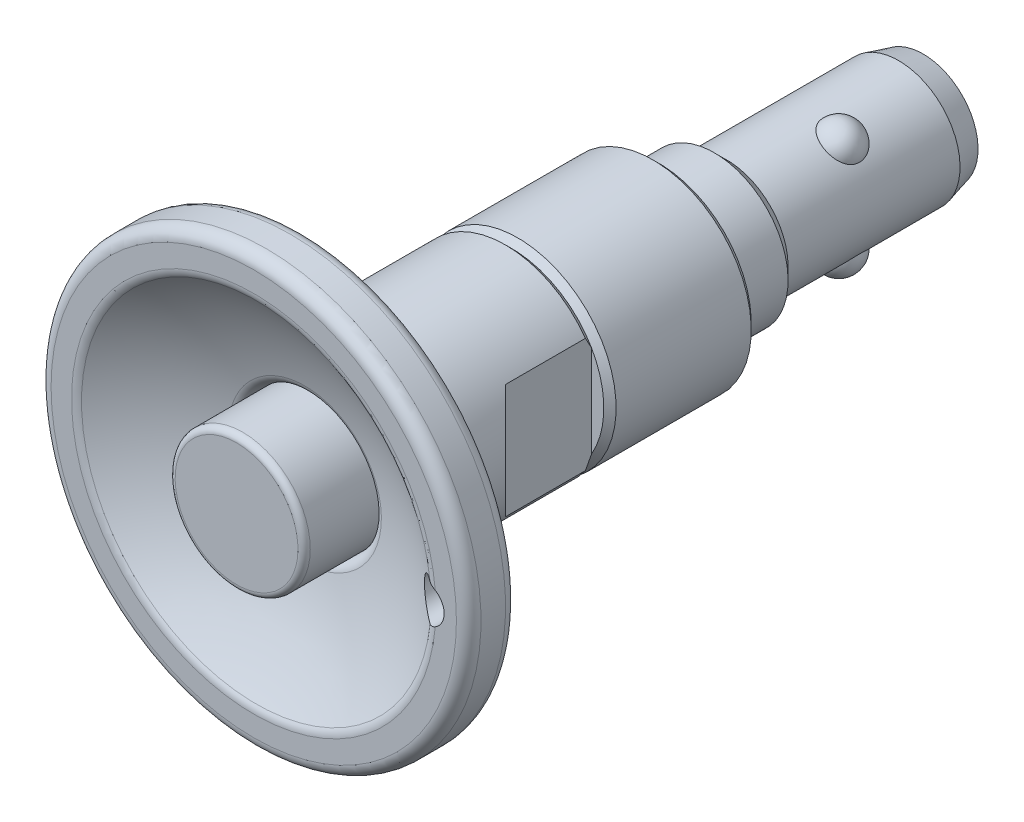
ISO-10303-21;
HEADER;
FILE_DESCRIPTION(('STEP AP214'),'2;1');
FILE_NAME('part.step','',(''),(''),'','','');
FILE_SCHEMA(('AUTOMOTIVE_DESIGN { 1 0 10303 214 1 1 1 1 }'));
ENDSEC;
DATA;
#1=APPLICATION_CONTEXT('core data for automotive mechanical design processes');
#2=APPLICATION_PROTOCOL_DEFINITION('international standard','automotive_design',2000,#1);
#3=PRODUCT_CONTEXT('',#1,'mechanical');
#4=PRODUCT('Part','Part','',(#3));
#5=PRODUCT_RELATED_PRODUCT_CATEGORY('part','',(#4));
#6=PRODUCT_DEFINITION_FORMATION('','',#4);
#7=PRODUCT_DEFINITION_CONTEXT('part definition',#1,'design');
#8=PRODUCT_DEFINITION('design','',#6,#7);
#9=PRODUCT_DEFINITION_SHAPE('','',#8);
#10=(LENGTH_UNIT() NAMED_UNIT(*) SI_UNIT(.MILLI.,.METRE.));
#11=(NAMED_UNIT(*) PLANE_ANGLE_UNIT() SI_UNIT($,.RADIAN.));
#12=(NAMED_UNIT(*) SI_UNIT($,.STERADIAN.) SOLID_ANGLE_UNIT());
#13=UNCERTAINTY_MEASURE_WITH_UNIT(LENGTH_MEASURE(1.E-05),#10,'distance_accuracy_value','');
#14=(GEOMETRIC_REPRESENTATION_CONTEXT(3) GLOBAL_UNCERTAINTY_ASSIGNED_CONTEXT((#13)) GLOBAL_UNIT_ASSIGNED_CONTEXT((#10,
#11,#12)) REPRESENTATION_CONTEXT('',''));
#15=CARTESIAN_POINT('',(0.,0.,0.));
#16=DIRECTION('',(0.,0.,1.));
#17=DIRECTION('',(1.,0.,0.));
#18=AXIS2_PLACEMENT_3D('',#15,#16,#17);
#19=CARTESIAN_POINT('',(0.,0.,64.6224672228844));
#20=DIRECTION('',(0.,0.,1.));
#21=DIRECTION('',(0.,-1.,0.));
#22=AXIS2_PLACEMENT_3D('',#19,#20,#21);
#23=CYLINDRICAL_SURFACE('',#22,5.);
#24=CARTESIAN_POINT('',(-4.70588235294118,-1.68957724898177,-12.5));
#25=CARTESIAN_POINT('',(-4.7058816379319,-1.68957831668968,-12.4163500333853));
#26=CARTESIAN_POINT('',(-4.70837703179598,-1.68267646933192,-12.3327063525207));
#27=CARTESIAN_POINT('',(-4.71805521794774,-1.65534315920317,-12.1679458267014));
#28=CARTESIAN_POINT('',(-4.72523829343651,-1.63491087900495,-12.0868291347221));
#29=CARTESIAN_POINT('',(-4.74343520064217,-1.5813326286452,-11.9295808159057));
#30=CARTESIAN_POINT('',(-4.75444114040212,-1.54821283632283,-11.853439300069));
#31=CARTESIAN_POINT('',(-4.77908644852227,-1.47037155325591,-11.7078220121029));
#32=CARTESIAN_POINT('',(-4.7927262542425,-1.42564813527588,-11.6383473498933));
#33=CARTESIAN_POINT('',(-4.82173213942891,-1.32429589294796,-11.5053666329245));
#34=CARTESIAN_POINT('',(-4.83714021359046,-1.26732417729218,-11.4421316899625));
#35=CARTESIAN_POINT('',(-4.86777124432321,-1.14404340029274,-11.3254940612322));
#36=CARTESIAN_POINT('',(-4.88299415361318,-1.07773200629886,-11.2720938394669));
#37=CARTESIAN_POINT('',(-4.91287952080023,-0.932462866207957,-11.1725460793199));
#38=CARTESIAN_POINT('',(-4.92742485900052,-0.852940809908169,-11.1271858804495));
#39=CARTESIAN_POINT('',(-4.95324708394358,-0.687293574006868,-11.0494432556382));
#40=CARTESIAN_POINT('',(-4.96452314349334,-0.601166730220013,-11.017064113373));
#41=CARTESIAN_POINT('',(-4.98313672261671,-0.420634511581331,-10.9646218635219));
#42=CARTESIAN_POINT('',(-4.99027773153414,-0.326031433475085,-10.9451676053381));
#43=CARTESIAN_POINT('',(-4.9991030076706,-0.134698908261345,-10.921228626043));
#44=CARTESIAN_POINT('',(-5.00078672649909,-0.0379692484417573,-10.9167454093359));
#45=CARTESIAN_POINT('',(-4.99851279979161,0.156336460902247,-10.922860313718));
#46=CARTESIAN_POINT('',(-4.99447419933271,0.25390485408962,-10.9336748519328));
#47=CARTESIAN_POINT('',(-4.98102180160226,0.445723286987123,-10.9706132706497));
#48=CARTESIAN_POINT('',(-4.97160774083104,0.539973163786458,-10.9967379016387));
#49=CARTESIAN_POINT('',(-4.94839574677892,0.722378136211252,-11.0638643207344));
#50=CARTESIAN_POINT('',(-4.93460076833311,0.810537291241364,-11.1048560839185));
#51=CARTESIAN_POINT('',(-4.90411782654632,0.978209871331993,-11.2010362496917));
#52=CARTESIAN_POINT('',(-4.88742986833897,1.05772331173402,-11.2562246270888));
#53=CARTESIAN_POINT('',(-4.85339662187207,1.20420084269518,-11.3786005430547));
#54=CARTESIAN_POINT('',(-4.83606922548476,1.27137003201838,-11.4455469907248));
#55=CARTESIAN_POINT('',(-4.80255134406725,1.39264827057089,-11.5906430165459));
#56=CARTESIAN_POINT('',(-4.78636047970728,1.44676169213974,-11.6687888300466));
#57=CARTESIAN_POINT('',(-4.7580282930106,1.53730410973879,-11.8296684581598));
#58=CARTESIAN_POINT('',(-4.74571390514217,1.57453853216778,-11.9119174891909));
#59=CARTESIAN_POINT('',(-4.72557053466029,1.63400803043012,-12.0821821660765));
#60=CARTESIAN_POINT('',(-4.7177389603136,1.6562517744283,-12.1701944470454));
#61=CARTESIAN_POINT('',(-4.70799736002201,1.68373270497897,-12.3424036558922));
#62=CARTESIAN_POINT('',(-4.70569000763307,1.69011238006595,-12.4263970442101));
#63=CARTESIAN_POINT('',(-4.70609981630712,1.68897215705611,-12.5942671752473));
#64=CARTESIAN_POINT('',(-4.70881580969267,1.68145548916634,-12.6781439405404));
#65=CARTESIAN_POINT('',(-4.71875745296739,1.65334034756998,-12.8402703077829));
#66=CARTESIAN_POINT('',(-4.72581832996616,1.63321939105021,-12.9186138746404));
#67=CARTESIAN_POINT('',(-4.74352838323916,1.58104146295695,-13.0707769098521));
#68=CARTESIAN_POINT('',(-4.75417791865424,1.548983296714,-13.1445959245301));
#69=CARTESIAN_POINT('',(-4.77834715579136,1.47276565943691,-13.2882095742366));
#70=CARTESIAN_POINT('',(-4.79194625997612,1.42825882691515,-13.3578059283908));
#71=CARTESIAN_POINT('',(-4.8204292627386,1.32895658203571,-13.4889165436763));
#72=CARTESIAN_POINT('',(-4.83531352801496,1.27415822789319,-13.5504284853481));
#73=CARTESIAN_POINT('',(-4.86601376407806,1.15159229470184,-13.668260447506));
#74=CARTESIAN_POINT('',(-4.88182228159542,1.08318658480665,-13.7239187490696));
#75=CARTESIAN_POINT('',(-4.91175690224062,0.938151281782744,-13.8237951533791));
#76=CARTESIAN_POINT('',(-4.92588250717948,0.861519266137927,-13.8680098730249));
#77=CARTESIAN_POINT('',(-4.95190213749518,0.697131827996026,-13.9466562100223));
#78=CARTESIAN_POINT('',(-4.96360846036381,0.608983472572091,-13.980330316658));
#79=CARTESIAN_POINT('',(-4.98247400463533,0.428052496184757,-14.033537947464));
#80=CARTESIAN_POINT('',(-4.98963246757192,0.335269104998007,-14.0530691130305));
#81=CARTESIAN_POINT('',(-4.99883289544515,0.144904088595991,-14.0780507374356));
#82=CARTESIAN_POINT('',(-5.00072521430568,0.0472609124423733,-14.0830895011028));
#83=CARTESIAN_POINT('',(-4.99877180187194,-0.147557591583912,-14.0778358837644));
#84=CARTESIAN_POINT('',(-4.99492569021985,-0.244732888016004,-14.0675424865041));
#85=CARTESIAN_POINT('',(-4.98184859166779,-0.436424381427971,-14.0316772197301));
#86=CARTESIAN_POINT('',(-4.97258733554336,-0.530922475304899,-14.0060194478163));
#87=CARTESIAN_POINT('',(-4.94962318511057,-0.7139624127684,-13.9397536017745));
#88=CARTESIAN_POINT('',(-4.93592012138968,-0.802504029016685,-13.8991449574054));
#89=CARTESIAN_POINT('',(-4.90566981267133,-0.970377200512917,-13.8040067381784));
#90=CARTESIAN_POINT('',(-4.8891438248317,-1.04977065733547,-13.7495798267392));
#91=CARTESIAN_POINT('',(-4.85505317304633,-1.19758887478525,-13.6276767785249));
#92=CARTESIAN_POINT('',(-4.83748862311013,-1.26601483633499,-13.5602020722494));
#93=CARTESIAN_POINT('',(-4.80405950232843,-1.38738934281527,-13.4162404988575));
#94=CARTESIAN_POINT('',(-4.78815718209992,-1.44079055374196,-13.3401450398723));
#95=CARTESIAN_POINT('',(-4.75938447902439,-1.53317114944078,-13.1791338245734));
#96=CARTESIAN_POINT('',(-4.74651232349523,-1.57215897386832,-13.0942232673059));
#97=CARTESIAN_POINT('',(-4.72640357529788,-1.63156862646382,-12.9253953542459));
#98=CARTESIAN_POINT('',(-4.71879210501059,-1.653248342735,-12.8419649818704));
#99=CARTESIAN_POINT('',(-4.70853280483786,-1.6822493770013,-12.6723534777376));
#100=CARTESIAN_POINT('',(-4.70588308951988,-1.68957614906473,-12.5861734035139));
#101=CARTESIAN_POINT('',(-4.70588235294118,-1.68957724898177,-12.5));
#102=B_SPLINE_CURVE_WITH_KNOTS('',3,(#24,#25,#26,#27,#28,#29,#30,#31,#32,#33,#34,#35,#36,#37,
#38,#39,#40,#41,#42,#43,#44,#45,#46,#47,#48,#49,#50,#51,#52,#53,#54,#55,#56,#57,#58,#59,#60,#61,
#62,#63,#64,#65,#66,#67,#68,#69,#70,#71,#72,#73,#74,#75,#76,#77,#78,#79,#80,#81,#82,#83,#84,#85,
#86,#87,#88,#89,#90,#91,#92,#93,#94,#95,#96,#97,#98,#99,#100,#101),.UNSPECIFIED.,.T.,.F.,(4,2,2,
2,2,2,2,2,2,2,2,2,2,2,2,2,2,2,2,2,2,2,2,2,2,2,2,2,2,2,2,2,2,2,2,2,2,2,4),(0.,0.25062442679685,
0.501263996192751,0.751389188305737,1.00155595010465,1.25994238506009,1.51839346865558,
1.79525043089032,2.07217738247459,2.36136682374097,2.65058532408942,2.9439365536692,
3.23730216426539,3.53047032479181,3.82363796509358,4.11137744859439,4.39902043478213,
4.67092933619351,4.94268087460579,5.19420759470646,5.44567585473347,5.68814976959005,
5.93064795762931,6.18073628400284,6.43089620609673,6.69851064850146,6.96620411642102,
7.25016014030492,7.53416350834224,7.82615869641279,8.11817323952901,8.41183588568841,
8.7055097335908,8.99706249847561,9.28858331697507,9.57004289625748,9.85133740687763,
10.1096204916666,10.3678054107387),.UNSPECIFIED.);
#103=CARTESIAN_POINT('',(-4.70588235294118,-1.68957724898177,-12.5));
#104=VERTEX_POINT('',#103);
#105=EDGE_CURVE('E28',#104,#104,#102,.T.);
#106=ORIENTED_EDGE('',*,*,#105,.F.);
#107=EDGE_LOOP('',(#106));
#108=FACE_BOUND('',#107,.T.);
#109=CARTESIAN_POINT('',(0.,0.,-5.5));
#110=DIRECTION('',(0.,0.,1.));
#111=DIRECTION('',(0.,-1.,0.));
#112=AXIS2_PLACEMENT_3D('',#109,#110,#111);
#113=CIRCLE('',#112,5.);
#114=CARTESIAN_POINT('',(0.,-5.,-5.5));
#115=VERTEX_POINT('',#114);
#116=EDGE_CURVE('E301',#115,#115,#113,.T.);
#117=ORIENTED_EDGE('',*,*,#116,.F.);
#118=EDGE_LOOP('',(#117));
#119=FACE_BOUND('',#118,.T.);
#120=CARTESIAN_POINT('',(0.,0.,-19.5));
#121=DIRECTION('',(0.,0.,1.));
#122=DIRECTION('',(0.,-1.,0.));
#123=AXIS2_PLACEMENT_3D('',#120,#121,#122);
#124=CIRCLE('',#123,5.);
#125=CARTESIAN_POINT('',(0.,-5.,-19.5));
#126=VERTEX_POINT('',#125);
#127=EDGE_CURVE('E295',#126,#126,#124,.T.);
#128=ORIENTED_EDGE('',*,*,#127,.T.);
#129=EDGE_LOOP('',(#128));
#130=FACE_BOUND('',#129,.T.);
#131=CARTESIAN_POINT('',(3.81615799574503,-3.23062504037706,-12.5));
#132=CARTESIAN_POINT('',(3.81615856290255,-3.23062388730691,-12.4163500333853));
#133=CARTESIAN_POINT('',(3.81142908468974,-3.23623588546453,-12.3327063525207));
#134=CARTESIAN_POINT('',(3.79259683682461,-3.25828409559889,-12.1679458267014));
#135=CARTESIAN_POINT('',(3.77849350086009,-3.27472096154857,-12.0868291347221));
#136=CARTESIAN_POINT('',(3.74119182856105,-3.31726907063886,-11.9295808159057));
#137=CARTESIAN_POINT('',(3.71801221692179,-3.34336039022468,-11.853439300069));
#138=CARTESIAN_POINT('',(3.66292234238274,-3.40362449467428,-11.7078220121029));
#139=CARTESIAN_POINT('',(3.63101062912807,-3.4377986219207,-11.6383473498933));
#140=CARTESIAN_POINT('',(3.55773995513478,-3.51359457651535,-11.5053666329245));
#141=CARTESIAN_POINT('',(3.51610503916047,-3.55542421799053,-11.4421316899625));
#142=CARTESIAN_POINT('',(3.42465626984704,-3.64359185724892,-11.3254940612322));
#143=CARTESIAN_POINT('',(3.37484037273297,-3.68993098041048,-11.2720938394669));
#144=CARTESIAN_POINT('',(3.26397629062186,-3.78844703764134,-11.1725460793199));
#145=CARTESIAN_POINT('',(3.20238083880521,-3.84080469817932,-11.1271858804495));
#146=CARTESIAN_POINT('',(3.07183723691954,-3.9459910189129,-11.0494432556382));
#147=CARTESIAN_POINT('',(3.00288723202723,-3.998819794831,-11.017064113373));
#148=CARTESIAN_POINT('',(2.85584853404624,-4.10520573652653,-10.9646218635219));
#149=CARTESIAN_POINT('',(2.77749036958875,-4.1586915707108,-10.9451676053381));
#150=CARTESIAN_POINT('',(2.61620418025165,-4.26200074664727,-10.921228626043));
#151=CARTESIAN_POINT('',(2.53327569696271,-4.31182371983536,-10.9167454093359));
#152=CARTESIAN_POINT('',(2.3638650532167,-4.40700729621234,-10.922860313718));
#153=CARTESIAN_POINT('',(2.27734904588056,-4.45229396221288,-10.9336748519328));
#154=CARTESIAN_POINT('',(2.10450321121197,-4.53655306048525,-10.9706132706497));
#155=CARTESIAN_POINT('',(2.01817339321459,-4.57552518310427,-10.9967379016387));
#156=CARTESIAN_POINT('',(1.84860005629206,-4.64662549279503,-11.0638643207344));
#157=CARTESIAN_POINT('',(1.7653544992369,-4.67875826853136,-11.1048560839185));
#158=CARTESIAN_POINT('',(1.60490431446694,-4.73619555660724,-11.2010362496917));
#159=CARTESIAN_POINT('',(1.52769967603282,-4.76150008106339,-11.2562246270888));
#160=CARTESIAN_POINT('',(1.38382978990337,-4.80526519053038,-11.3786005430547));
#161=CARTESIAN_POINT('',(1.31699586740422,-4.82384381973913,-11.4455469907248));
#162=CARTESIAN_POINT('',(1.19520689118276,-4.85545560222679,-11.5906430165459));
#163=CARTESIAN_POINT('',(1.14024786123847,-4.86849061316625,-11.6687888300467));
#164=CARTESIAN_POINT('',(1.04766973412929,-4.88922542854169,-11.8296684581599));
#165=CARTESIAN_POINT('',(1.00926658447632,-4.89717806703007,-11.9119174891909));
#166=CARTESIAN_POINT('',(0.947692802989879,-4.90946814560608,-12.0821821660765));
#167=CARTESIAN_POINT('',(0.924513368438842,-4.91380767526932,-12.1701944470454));
#168=CARTESIAN_POINT('',(0.895843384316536,-4.91911166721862,-12.3424036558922));
#169=CARTESIAN_POINT('',(0.889164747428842,-4.92030327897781,-12.4263970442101));
#170=CARTESIAN_POINT('',(0.890357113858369,-4.9200880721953,-12.5942671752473));
#171=CARTESIAN_POINT('',(0.89822473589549,-4.91868185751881,-12.6781439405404));
#172=CARTESIAN_POINT('',(0.927543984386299,-4.9132340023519,-12.8402703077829));
#173=CARTESIAN_POINT('',(0.948499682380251,-4.90928842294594,-12.9186138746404));
#174=CARTESIAN_POINT('',(1.00254212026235,-4.89853681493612,-13.0707769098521));
#175=CARTESIAN_POINT('',(1.03563007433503,-4.89173050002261,-13.1445959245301));
#176=CARTESIAN_POINT('',(1.11372110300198,-4.87455285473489,-13.2882095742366));
#177=CARTESIAN_POINT('',(1.15906470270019,-4.86407660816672,-13.3578059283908));
#178=CARTESIAN_POINT('',(1.25930447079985,-4.83909248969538,-13.4889165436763));
#179=CARTESIAN_POINT('',(1.31420337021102,-4.82458346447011,-13.5504284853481));
#180=CARTESIAN_POINT('',(1.43569870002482,-4.78988768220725,-13.668260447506));
#181=CARTESIAN_POINT('',(1.50284404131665,-4.76937540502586,-13.7239187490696));
#182=CARTESIAN_POINT('',(1.64341560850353,-4.72278189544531,-13.8237951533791));
#183=CARTESIAN_POINT('',(1.71684368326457,-4.69669902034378,-13.8680098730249));
#184=CARTESIAN_POINT('',(1.87221719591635,-4.63703896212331,-13.9466562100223));
#185=CARTESIAN_POINT('',(1.95440907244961,-4.60310275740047,-13.980330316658));
#186=CARTESIAN_POINT('',(2.12053266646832,-4.52897530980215,-14.033537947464));
#187=CARTESIAN_POINT('',(2.20446467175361,-4.48878302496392,-14.0530691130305));
#188=CARTESIAN_POINT('',(2.37392582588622,-4.40156832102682,-14.0780507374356));
#189=CARTESIAN_POINT('',(2.45943345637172,-4.35438552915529,-14.0830895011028));
#190=CARTESIAN_POINT('',(2.62717452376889,-4.25528457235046,-14.0778358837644));
#191=CARTESIAN_POINT('',(2.70940774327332,-4.20336609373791,-14.0675424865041));
#192=CARTESIAN_POINT('',(2.86887889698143,-4.09619524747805,-14.0316772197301));
#193=CARTESIAN_POINT('',(2.94608601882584,-4.04092571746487,-14.0060194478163));
#194=CARTESIAN_POINT('',(3.09312117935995,-3.929518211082,-13.9397536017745));
#195=CARTESIAN_POINT('',(3.16294893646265,-3.87338020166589,-13.8991449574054));
#196=CARTESIAN_POINT('',(3.29320621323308,-3.76324608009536,-13.8040067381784));
#197=CARTESIAN_POINT('',(3.35369996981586,-3.70923742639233,-13.7495798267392));
#198=CARTESIAN_POINT('',(3.46466897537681,-3.60580494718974,-13.6276767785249));
#199=CARTESIAN_POINT('',(3.51514532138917,-3.55638061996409,-13.5602020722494));
#200=CARTESIAN_POINT('',(3.60354416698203,-3.46674289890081,-13.4162404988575));
#201=CARTESIAN_POINT('',(3.64183981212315,-3.42627048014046,-13.3401450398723));
#202=CARTESIAN_POINT('',(3.7074574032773,-3.3551622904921,-13.1791338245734));
#203=CARTESIAN_POINT('',(3.73478577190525,-3.32452076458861,-13.0942232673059));
#204=CARTESIAN_POINT('',(3.77618166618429,-3.27740125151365,-12.9253953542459));
#205=CARTESIAN_POINT('',(3.79115111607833,-3.25996966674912,-12.8419649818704));
#206=CARTESIAN_POINT('',(3.8111370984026,-3.23658433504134,-12.6723534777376));
#207=CARTESIAN_POINT('',(3.81615741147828,-3.23062622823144,-12.5861734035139));
#208=CARTESIAN_POINT('',(3.81615799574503,-3.23062504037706,-12.5));
#209=B_SPLINE_CURVE_WITH_KNOTS('',3,(#131,#132,#133,#134,#135,#136,#137,#138,#139,#140,#141,
#142,#143,#144,#145,#146,#147,#148,#149,#150,#151,#152,#153,#154,#155,#156,#157,#158,#159,#160,
#161,#162,#163,#164,#165,#166,#167,#168,#169,#170,#171,#172,#173,#174,#175,#176,#177,#178,#179,
#180,#181,#182,#183,#184,#185,#186,#187,#188,#189,#190,#191,#192,#193,#194,#195,#196,#197,#198,
#199,#200,#201,#202,#203,#204,#205,#206,#207,#208),.UNSPECIFIED.,.T.,.F.,(4,2,2,2,2,2,2,2,2,2,2,
2,2,2,2,2,2,2,2,2,2,2,2,2,2,2,2,2,2,2,2,2,2,2,2,2,2,2,4),(0.,0.25062442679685,0.501263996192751,
0.751389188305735,1.00155595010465,1.25994238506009,1.51839346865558,1.79525043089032,
2.07217738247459,2.36136682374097,2.65058532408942,2.9439365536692,3.23730216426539,
3.53047032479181,3.82363796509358,4.1113774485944,4.39902043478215,4.67092933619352,
4.94268087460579,5.19420759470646,5.44567585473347,5.68814976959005,5.93064795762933,
6.18073628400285,6.43089620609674,6.69851064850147,6.96620411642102,7.25016014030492,
7.53416350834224,7.82615869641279,8.11817323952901,8.41183588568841,8.7055097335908,
8.99706249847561,9.28858331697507,9.57004289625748,9.85133740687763,10.1096204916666,
10.3678054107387),.UNSPECIFIED.);
#210=CARTESIAN_POINT('',(3.81615799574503,-3.23062504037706,-12.5));
#211=VERTEX_POINT('',#210);
#212=EDGE_CURVE('E118',#211,#211,#209,.T.);
#213=ORIENTED_EDGE('',*,*,#212,.F.);
#214=EDGE_LOOP('',(#213));
#215=FACE_BOUND('',#214,.T.);
#216=CARTESIAN_POINT('',(3.816157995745,3.23062504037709,-12.5));
#217=CARTESIAN_POINT('',(3.81615856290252,3.23062388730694,-12.5836499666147));
#218=CARTESIAN_POINT('',(3.81142908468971,3.23623588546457,-12.6672936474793));
#219=CARTESIAN_POINT('',(3.79259683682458,3.25828409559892,-12.8320541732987));
#220=CARTESIAN_POINT('',(3.77849350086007,3.2747209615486,-12.913170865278));
#221=CARTESIAN_POINT('',(3.74119182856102,3.31726907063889,-13.0704191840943));
#222=CARTESIAN_POINT('',(3.71801221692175,3.34336039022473,-13.146560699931));
#223=CARTESIAN_POINT('',(3.6629223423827,3.40362449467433,-13.2921779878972));
#224=CARTESIAN_POINT('',(3.63101062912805,3.43779862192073,-13.3616526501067));
#225=CARTESIAN_POINT('',(3.55773995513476,3.51359457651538,-13.4946333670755));
#226=CARTESIAN_POINT('',(3.51610503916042,3.55542421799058,-13.5578683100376));
#227=CARTESIAN_POINT('',(3.42465626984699,3.64359185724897,-13.6745059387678));
#228=CARTESIAN_POINT('',(3.37484037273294,3.68993098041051,-13.7279061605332));
#229=CARTESIAN_POINT('',(3.26397629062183,3.78844703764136,-13.8274539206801));
#230=CARTESIAN_POINT('',(3.20238083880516,3.84080469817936,-13.8728141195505));
#231=CARTESIAN_POINT('',(3.07183723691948,3.94599101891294,-13.9505567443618));
#232=CARTESIAN_POINT('',(3.00288723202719,3.99881979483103,-13.982935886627));
#233=CARTESIAN_POINT('',(2.85584853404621,4.10520573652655,-14.0353781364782));
#234=CARTESIAN_POINT('',(2.77749036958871,4.15869157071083,-14.0548323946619));
#235=CARTESIAN_POINT('',(2.61620418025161,4.26200074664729,-14.078771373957));
#236=CARTESIAN_POINT('',(2.53327569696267,4.31182371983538,-14.0832545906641));
#237=CARTESIAN_POINT('',(2.36386505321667,4.40700729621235,-14.0771396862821));
#238=CARTESIAN_POINT('',(2.27734904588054,4.4522939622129,-14.0663251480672));
#239=CARTESIAN_POINT('',(2.10450321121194,4.53655306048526,-14.0293867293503));
#240=CARTESIAN_POINT('',(2.01817339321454,4.57552518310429,-14.0032620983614));
#241=CARTESIAN_POINT('',(1.84860005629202,4.64662549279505,-13.9361356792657));
#242=CARTESIAN_POINT('',(1.7653544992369,4.67875826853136,-13.8951439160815));
#243=CARTESIAN_POINT('',(1.60490431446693,4.73619555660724,-13.7989637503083));
#244=CARTESIAN_POINT('',(1.52769967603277,4.7615000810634,-13.7437753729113));
#245=CARTESIAN_POINT('',(1.38382978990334,4.80526519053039,-13.6213994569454));
#246=CARTESIAN_POINT('',(1.31699586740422,4.82384381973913,-13.5544530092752));
#247=CARTESIAN_POINT('',(1.19520689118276,4.85545560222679,-13.4093569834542));
#248=CARTESIAN_POINT('',(1.14024786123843,4.86849061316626,-13.3312111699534));
#249=CARTESIAN_POINT('',(1.04766973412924,4.8892254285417,-13.1703315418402));
#250=CARTESIAN_POINT('',(1.0092665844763,4.89717806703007,-13.0880825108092));
#251=CARTESIAN_POINT('',(0.94769280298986,4.90946814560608,-12.9178178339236));
#252=CARTESIAN_POINT('',(0.924513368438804,4.91380767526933,-12.8298055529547));
#253=CARTESIAN_POINT('',(0.895843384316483,4.91911166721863,-12.6575963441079));
#254=CARTESIAN_POINT('',(0.889164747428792,4.92030327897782,-12.57360295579));
#255=CARTESIAN_POINT('',(0.890357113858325,4.9200880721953,-12.4057328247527));
#256=CARTESIAN_POINT('',(0.89822473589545,4.91868185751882,-12.3218560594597));
#257=CARTESIAN_POINT('',(0.927543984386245,4.91323400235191,-12.1597296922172));
#258=CARTESIAN_POINT('',(0.94849968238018,4.90928842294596,-12.0813861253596));
#259=CARTESIAN_POINT('',(1.00254212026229,4.89853681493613,-11.929223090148));
#260=CARTESIAN_POINT('',(1.03563007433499,4.89173050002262,-11.85540407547));
#261=CARTESIAN_POINT('',(1.11372110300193,4.8745528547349,-11.7117904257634));
#262=CARTESIAN_POINT('',(1.1590647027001,4.86407660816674,-11.6421940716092));
#263=CARTESIAN_POINT('',(1.25930447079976,4.8390924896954,-11.5110834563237));
#264=CARTESIAN_POINT('',(1.31420337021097,4.82458346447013,-11.449571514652));
#265=CARTESIAN_POINT('',(1.43569870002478,4.78988768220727,-11.3317395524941));
#266=CARTESIAN_POINT('',(1.50284404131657,4.76937540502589,-11.2760812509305));
#267=CARTESIAN_POINT('',(1.64341560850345,4.72278189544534,-11.176204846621));
#268=CARTESIAN_POINT('',(1.71684368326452,4.6966990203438,-11.1319901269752));
#269=CARTESIAN_POINT('',(1.87221719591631,4.63703896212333,-11.0533437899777));
#270=CARTESIAN_POINT('',(1.95440907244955,4.60310275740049,-11.019669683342));
#271=CARTESIAN_POINT('',(2.12053266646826,4.52897530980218,-10.9664620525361));
#272=CARTESIAN_POINT('',(2.20446467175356,4.48878302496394,-10.9469308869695));
#273=CARTESIAN_POINT('',(2.37392582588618,4.40156832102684,-10.9219492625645));
#274=CARTESIAN_POINT('',(2.45943345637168,4.35438552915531,-10.9169104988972));
#275=CARTESIAN_POINT('',(2.62717452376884,4.25528457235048,-10.9221641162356));
#276=CARTESIAN_POINT('',(2.70940774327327,4.20336609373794,-10.9324575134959));
#277=CARTESIAN_POINT('',(2.86887889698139,4.09619524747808,-10.9683227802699));
#278=CARTESIAN_POINT('',(2.94608601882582,4.04092571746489,-10.9939805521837));
#279=CARTESIAN_POINT('',(3.09312117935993,3.92951821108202,-11.0602463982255));
#280=CARTESIAN_POINT('',(3.16294893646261,3.87338020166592,-11.1008550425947));
#281=CARTESIAN_POINT('',(3.29320621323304,3.76324608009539,-11.1959932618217));
#282=CARTESIAN_POINT('',(3.35369996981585,3.70923742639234,-11.2504201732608));
#283=CARTESIAN_POINT('',(3.4646689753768,3.60580494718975,-11.3723232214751));
#284=CARTESIAN_POINT('',(3.51514532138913,3.55638061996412,-11.4397979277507));
#285=CARTESIAN_POINT('',(3.603544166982,3.46674289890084,-11.5837595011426));
#286=CARTESIAN_POINT('',(3.64183981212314,3.42627048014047,-11.6598549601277));
#287=CARTESIAN_POINT('',(3.70745740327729,3.35516229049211,-11.8208661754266));
#288=CARTESIAN_POINT('',(3.73478577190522,3.32452076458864,-11.9057767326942));
#289=CARTESIAN_POINT('',(3.77618166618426,3.27740125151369,-12.0746046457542));
#290=CARTESIAN_POINT('',(3.7911511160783,3.25996966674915,-12.1580350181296));
#291=CARTESIAN_POINT('',(3.81113709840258,3.23658433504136,-12.3276465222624));
#292=CARTESIAN_POINT('',(3.81615741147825,3.23062622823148,-12.4138265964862));
#293=CARTESIAN_POINT('',(3.816157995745,3.23062504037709,-12.5));
#294=B_SPLINE_CURVE_WITH_KNOTS('',3,(#216,#217,#218,#219,#220,#221,#222,#223,#224,#225,#226,
#227,#228,#229,#230,#231,#232,#233,#234,#235,#236,#237,#238,#239,#240,#241,#242,#243,#244,#245,
#246,#247,#248,#249,#250,#251,#252,#253,#254,#255,#256,#257,#258,#259,#260,#261,#262,#263,#264,
#265,#266,#267,#268,#269,#270,#271,#272,#273,#274,#275,#276,#277,#278,#279,#280,#281,#282,#283,
#284,#285,#286,#287,#288,#289,#290,#291,#292,#293),.UNSPECIFIED.,.T.,.F.,(4,2,2,2,2,2,2,2,2,2,2,
2,2,2,2,2,2,2,2,2,2,2,2,2,2,2,2,2,2,2,2,2,2,2,2,2,2,2,4),(0.,0.25062442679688,0.501263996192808,
0.751389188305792,1.0015559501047,1.25994238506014,1.51839346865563,1.79525043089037,
2.07217738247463,2.361366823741,2.65058532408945,2.94393655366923,3.23730216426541,
3.53047032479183,3.82363796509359,4.11137744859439,4.39902043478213,4.67092933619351,
4.94268087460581,5.19420759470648,5.44567585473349,5.68814976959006,5.93064795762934,
6.18073628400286,6.43089620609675,6.69851064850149,6.96620411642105,7.25016014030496,
7.53416350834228,7.82615869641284,8.11817323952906,8.41183588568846,8.70550973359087,
8.99706249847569,9.28858331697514,9.57004289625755,9.85133740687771,10.1096204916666,
10.3678054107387),.UNSPECIFIED.);
#295=CARTESIAN_POINT('',(3.816157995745,3.23062504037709,-12.5));
#296=VERTEX_POINT('',#295);
#297=EDGE_CURVE('E9',#296,#296,#294,.T.);
#298=ORIENTED_EDGE('',*,*,#297,.F.);
#299=EDGE_LOOP('',(#298));
#300=FACE_BOUND('',#299,.T.);
#301=ADVANCED_FACE('F14',(#108,#119,#130,#215,#300),#23,.T.);
#302=CARTESIAN_POINT('',(0.,0.,0.5));
#303=DIRECTION('',(0.,0.,1.));
#304=DIRECTION('',(0.16499025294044,0.986295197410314,0.));
#305=AXIS2_PLACEMENT_3D('',#302,#303,#304);
#306=CONICAL_SURFACE('',#305,8.,0.78539816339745);
#307=CARTESIAN_POINT('',(0.,0.,0.));
#308=DIRECTION('',(0.,0.,1.));
#309=DIRECTION('',(0.16499025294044,0.986295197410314,0.));
#310=AXIS2_PLACEMENT_3D('',#307,#308,#309);
#311=CIRCLE('',#310,7.5);
#312=CARTESIAN_POINT('',(1.2374268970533,7.39721398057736,0.));
#313=VERTEX_POINT('',#312);
#314=EDGE_CURVE('E131',#313,#313,#311,.F.);
#315=ORIENTED_EDGE('',*,*,#314,.F.);
#316=EDGE_LOOP('',(#315));
#317=FACE_BOUND('',#316,.T.);
#318=CARTESIAN_POINT('',(0.,0.,0.5));
#319=DIRECTION('',(0.,0.,1.));
#320=DIRECTION('',(0.16499025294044,0.986295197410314,0.));
#321=AXIS2_PLACEMENT_3D('',#318,#319,#320);
#322=CIRCLE('',#321,8.);
#323=CARTESIAN_POINT('',(1.31992202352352,7.89036157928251,0.5));
#324=VERTEX_POINT('',#323);
#325=EDGE_CURVE('E133',#324,#324,#322,.T.);
#326=ORIENTED_EDGE('',*,*,#325,.F.);
#327=EDGE_LOOP('',(#326));
#328=FACE_BOUND('',#327,.T.);
#329=ADVANCED_FACE('F354',(#317,#328),#306,.T.);
#330=CARTESIAN_POINT('',(0.,0.,0.));
#331=DIRECTION('',(0.,0.,1.));
#332=DIRECTION('',(0.16499025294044,0.986295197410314,0.));
#333=AXIS2_PLACEMENT_3D('',#330,#331,#332);
#334=PLANE('',#333);
#335=ORIENTED_EDGE('',*,*,#314,.T.);
#336=EDGE_LOOP('',(#335));
#337=FACE_BOUND('',#336,.T.);
#338=CARTESIAN_POINT('',(0.,0.,0.));
#339=DIRECTION('',(0.,0.,1.));
#340=DIRECTION('',(0.,-1.,0.));
#341=AXIS2_PLACEMENT_3D('',#338,#339,#340);
#342=CIRCLE('',#341,6.);
#343=CARTESIAN_POINT('',(0.,-6.,0.));
#344=VERTEX_POINT('',#343);
#345=EDGE_CURVE('E127',#344,#344,#342,.F.);
#346=ORIENTED_EDGE('',*,*,#345,.F.);
#347=EDGE_LOOP('',(#346));
#348=FACE_BOUND('',#347,.T.);
#349=ADVANCED_FACE('F380',(#337,#348),#334,.F.);
#350=CARTESIAN_POINT('',(0.,0.,12.));
#351=DIRECTION('',(0.,0.,1.));
#352=DIRECTION('',(0.16499025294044,0.986295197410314,0.));
#353=AXIS2_PLACEMENT_3D('',#350,#351,#352);
#354=PLANE('',#353);
#355=CARTESIAN_POINT('',(0.,0.,12.));
#356=DIRECTION('',(0.,0.,1.));
#357=DIRECTION('',(0.16499025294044,0.986295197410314,0.));
#358=AXIS2_PLACEMENT_3D('',#355,#356,#357);
#359=CIRCLE('',#358,7.5);
#360=CARTESIAN_POINT('',(6.5,-3.74165738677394,12.));
#361=VERTEX_POINT('',#360);
#362=CARTESIAN_POINT('',(6.5,3.74165738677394,12.));
#363=VERTEX_POINT('',#362);
#364=EDGE_CURVE('E103',#361,#363,#359,.T.);
#365=ORIENTED_EDGE('',*,*,#364,.T.);
#366=DIRECTION('',(0.,-1.,0.));
#367=VECTOR('',#366,1.);
#368=CARTESIAN_POINT('',(6.5,0.,12.));
#369=LINE('',#368,#367);
#370=EDGE_CURVE('E119',#363,#361,#369,.T.);
#371=ORIENTED_EDGE('',*,*,#370,.T.);
#372=EDGE_LOOP('',(#365,#371));
#373=FACE_BOUND('',#372,.T.);
#374=ADVANCED_FACE('F379',(#373),#354,.T.);
#375=CARTESIAN_POINT('',(-6.5,3.74165738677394,12.));
#376=VERTEX_POINT('',#375);
#377=CARTESIAN_POINT('',(-6.5,-3.74165738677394,12.));
#378=VERTEX_POINT('',#377);
#379=EDGE_CURVE('E101',#376,#378,#359,.T.);
#380=ORIENTED_EDGE('',*,*,#379,.T.);
#381=DIRECTION('',(0.,1.,0.));
#382=VECTOR('',#381,1.);
#383=CARTESIAN_POINT('',(-6.5,0.,12.));
#384=LINE('',#383,#382);
#385=EDGE_CURVE('E111',#378,#376,#384,.T.);
#386=ORIENTED_EDGE('',*,*,#385,.T.);
#387=EDGE_LOOP('',(#380,#386));
#388=FACE_BOUND('',#387,.T.);
#389=ADVANCED_FACE('F126',(#388),#354,.T.);
#390=CARTESIAN_POINT('',(0.,0.,12.));
#391=DIRECTION('',(0.,0.,-1.));
#392=DIRECTION('',(-0.16499025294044,-0.986295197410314,0.));
#393=AXIS2_PLACEMENT_3D('',#390,#391,#392);
#394=CYLINDRICAL_SURFACE('',#393,8.);
#395=ORIENTED_EDGE('',*,*,#325,.T.);
#396=EDGE_LOOP('',(#395));
#397=FACE_BOUND('',#396,.T.);
#398=CARTESIAN_POINT('',(0.,0.,11.5));
#399=DIRECTION('',(0.,0.,1.));
#400=DIRECTION('',(0.16499025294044,0.986295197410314,0.));
#401=AXIS2_PLACEMENT_3D('',#398,#399,#400);
#402=CIRCLE('',#401,8.);
#403=CARTESIAN_POINT('',(1.31992202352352,7.89036157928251,11.5));
#404=VERTEX_POINT('',#403);
#405=EDGE_CURVE('E137',#404,#404,#402,.F.);
#406=ORIENTED_EDGE('',*,*,#405,.T.);
#407=EDGE_LOOP('',(#406));
#408=FACE_BOUND('',#407,.T.);
#409=ADVANCED_FACE('F378',(#397,#408),#394,.T.);
#410=CARTESIAN_POINT('',(0.,0.,12.));
#411=DIRECTION('',(0.,0.,-1.));
#412=DIRECTION('',(-0.16499025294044,-0.986295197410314,0.));
#413=AXIS2_PLACEMENT_3D('',#410,#411,#412);
#414=CONICAL_SURFACE('',#413,7.5,0.785398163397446);
#415=ORIENTED_EDGE('',*,*,#405,.F.);
#416=EDGE_LOOP('',(#415));
#417=FACE_BOUND('',#416,.T.);
#418=ORIENTED_EDGE('',*,*,#379,.F.);
#419=EDGE_CURVE('E36',#363,#376,#359,.T.);
#420=ORIENTED_EDGE('',*,*,#419,.F.);
#421=ORIENTED_EDGE('',*,*,#364,.F.);
#422=EDGE_CURVE('E97',#378,#361,#359,.T.);
#423=ORIENTED_EDGE('',*,*,#422,.F.);
#424=EDGE_LOOP('',(#418,#420,#421,#423));
#425=FACE_BOUND('',#424,.T.);
#426=ADVANCED_FACE('F99',(#417,#425),#414,.T.);
#427=CARTESIAN_POINT('',(0.,0.,-17.1));
#428=DIRECTION('',(0.,0.,-1.));
#429=DIRECTION('',(0.,1.,0.));
#430=AXIS2_PLACEMENT_3D('',#427,#428,#429);
#431=PLANE('',#430);
#432=CARTESIAN_POINT('',(0.,0.,-17.1));
#433=DIRECTION('',(0.,0.,-1.));
#434=DIRECTION('',(0.,1.,0.));
#435=AXIS2_PLACEMENT_3D('',#432,#433,#434);
#436=CIRCLE('',#435,3.75);
#437=CARTESIAN_POINT('',(0.,3.75,-17.1));
#438=VERTEX_POINT('',#437);
#439=EDGE_CURVE('E154',#438,#438,#436,.T.);
#440=ORIENTED_EDGE('',*,*,#439,.T.);
#441=EDGE_LOOP('',(#440));
#442=FACE_BOUND('',#441,.T.);
#443=ADVANCED_FACE('F177',(#442),#431,.T.);
#444=CARTESIAN_POINT('',(0.,0.,-15.5));
#445=DIRECTION('',(0.,0.,-1.));
#446=DIRECTION('',(0.,1.,0.));
#447=AXIS2_PLACEMENT_3D('',#444,#445,#446);
#448=CYLINDRICAL_SURFACE('',#447,3.75);
#449=ORIENTED_EDGE('',*,*,#439,.F.);
#450=EDGE_LOOP('',(#449));
#451=FACE_BOUND('',#450,.T.);
#452=CARTESIAN_POINT('',(0.,0.,-21.3));
#453=DIRECTION('',(0.,0.,1.));
#454=DIRECTION('',(0.,-1.,0.));
#455=AXIS2_PLACEMENT_3D('',#452,#453,#454);
#456=CIRCLE('',#455,3.75);
#457=CARTESIAN_POINT('',(0.,-3.75,-21.3));
#458=VERTEX_POINT('',#457);
#459=EDGE_CURVE('E289',#458,#458,#456,.F.);
#460=ORIENTED_EDGE('',*,*,#459,.T.);
#461=EDGE_LOOP('',(#460));
#462=FACE_BOUND('',#461,.T.);
#463=ADVANCED_FACE('F343',(#451,#462),#448,.F.);
#464=CARTESIAN_POINT('',(0.,0.,-21.3));
#465=DIRECTION('',(0.,0.,-1.));
#466=DIRECTION('',(0.,1.,0.));
#467=AXIS2_PLACEMENT_3D('',#464,#465,#466);
#468=CONICAL_SURFACE('',#467,3.75,0.785398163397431);
#469=CARTESIAN_POINT('',(0.,0.,-21.5));
#470=DIRECTION('',(0.,0.,1.));
#471=DIRECTION('',(0.,-1.,0.));
#472=AXIS2_PLACEMENT_3D('',#469,#470,#471);
#473=CIRCLE('',#472,3.95);
#474=CARTESIAN_POINT('',(0.,-3.95,-21.5));
#475=VERTEX_POINT('',#474);
#476=EDGE_CURVE('E286',#475,#475,#473,.T.);
#477=ORIENTED_EDGE('',*,*,#476,.F.);
#478=EDGE_LOOP('',(#477));
#479=FACE_BOUND('',#478,.T.);
#480=ORIENTED_EDGE('',*,*,#459,.F.);
#481=EDGE_LOOP('',(#480));
#482=FACE_BOUND('',#481,.T.);
#483=ADVANCED_FACE('F212',(#479,#482),#468,.F.);
#484=CARTESIAN_POINT('',(5.,0.,-21.5));
#485=DIRECTION('',(0.,0.,1.));
#486=DIRECTION('',(0.,-1.,0.));
#487=AXIS2_PLACEMENT_3D('',#484,#485,#486);
#488=PLANE('',#487);
#489=ORIENTED_EDGE('',*,*,#476,.T.);
#490=EDGE_LOOP('',(#489));
#491=FACE_BOUND('',#490,.T.);
#492=CARTESIAN_POINT('',(0.,0.,-21.5));
#493=DIRECTION('',(0.,0.,1.));
#494=DIRECTION('',(0.,-1.,0.));
#495=AXIS2_PLACEMENT_3D('',#492,#493,#494);
#496=CIRCLE('',#495,4.46410161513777);
#497=CARTESIAN_POINT('',(0.,-4.46410161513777,-21.5));
#498=VERTEX_POINT('',#497);
#499=EDGE_CURVE('E292',#498,#498,#496,.F.);
#500=ORIENTED_EDGE('',*,*,#499,.T.);
#501=EDGE_LOOP('',(#500));
#502=FACE_BOUND('',#501,.T.);
#503=ADVANCED_FACE('F347',(#491,#502),#488,.F.);
#504=CARTESIAN_POINT('',(0.,0.,-19.5));
#505=DIRECTION('',(0.,0.,1.));
#506=DIRECTION('',(0.,-1.,0.));
#507=AXIS2_PLACEMENT_3D('',#504,#505,#506);
#508=CONICAL_SURFACE('',#507,5.,0.261799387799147);
#509=ORIENTED_EDGE('',*,*,#499,.F.);
#510=EDGE_LOOP('',(#509));
#511=FACE_BOUND('',#510,.T.);
#512=ORIENTED_EDGE('',*,*,#127,.F.);
#513=EDGE_LOOP('',(#512));
#514=FACE_BOUND('',#513,.T.);
#515=ADVANCED_FACE('F349',(#511,#514),#508,.T.);
#516=CARTESIAN_POINT('',(0.,0.,-4.5));
#517=DIRECTION('',(0.,0.,1.));
#518=DIRECTION('',(0.,-1.,0.));
#519=AXIS2_PLACEMENT_3D('',#516,#517,#518);
#520=CONICAL_SURFACE('',#519,6.,0.785398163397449);
#521=ORIENTED_EDGE('',*,*,#116,.T.);
#522=EDGE_LOOP('',(#521));
#523=FACE_BOUND('',#522,.T.);
#524=CARTESIAN_POINT('',(0.,0.,-4.5));
#525=DIRECTION('',(0.,0.,1.));
#526=DIRECTION('',(0.,-1.,0.));
#527=AXIS2_PLACEMENT_3D('',#524,#525,#526);
#528=CIRCLE('',#527,6.);
#529=CARTESIAN_POINT('',(0.,-6.,-4.5));
#530=VERTEX_POINT('',#529);
#531=EDGE_CURVE('E298',#530,#530,#528,.T.);
#532=ORIENTED_EDGE('',*,*,#531,.F.);
#533=EDGE_LOOP('',(#532));
#534=FACE_BOUND('',#533,.T.);
#535=ADVANCED_FACE('F521',(#523,#534),#520,.T.);
#536=CARTESIAN_POINT('',(0.,0.,64.6224672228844));
#537=DIRECTION('',(0.,0.,1.));
#538=DIRECTION('',(0.,-1.,0.));
#539=AXIS2_PLACEMENT_3D('',#536,#537,#538);
#540=CYLINDRICAL_SURFACE('',#539,6.);
#541=ORIENTED_EDGE('',*,*,#531,.T.);
#542=EDGE_LOOP('',(#541));
#543=FACE_BOUND('',#542,.T.);
#544=ORIENTED_EDGE('',*,*,#345,.T.);
#545=EDGE_LOOP('',(#544));
#546=FACE_BOUND('',#545,.T.);
#547=ADVANCED_FACE('F356',(#543,#546),#540,.T.);
#548=CARTESIAN_POINT('',(0.,0.,34.4));
#549=DIRECTION('',(0.,0.,-1.));
#550=DIRECTION('',(0.,1.,0.));
#551=AXIS2_PLACEMENT_3D('',#548,#549,#550);
#552=PLANE('',#551);
#553=CARTESIAN_POINT('',(0.,0.,34.4));
#554=DIRECTION('',(0.,0.,-1.));
#555=DIRECTION('',(0.,1.,0.));
#556=AXIS2_PLACEMENT_3D('',#553,#554,#555);
#557=CIRCLE('',#556,5.);
#558=CARTESIAN_POINT('',(0.,5.,34.4));
#559=VERTEX_POINT('',#558);
#560=EDGE_CURVE('E150',#559,#559,#557,.F.);
#561=ORIENTED_EDGE('',*,*,#560,.T.);
#562=EDGE_LOOP('',(#561));
#563=FACE_BOUND('',#562,.T.);
#564=ADVANCED_FACE('F396',(#563),#552,.F.);
#565=CARTESIAN_POINT('',(0.,0.,33.9));
#566=DIRECTION('',(0.,0.,-1.));
#567=DIRECTION('',(0.,1.,0.));
#568=AXIS2_PLACEMENT_3D('',#565,#566,#567);
#569=TOROIDAL_SURFACE('',#568,5.,0.5);
#570=CARTESIAN_POINT('',(0.,0.,33.9));
#571=DIRECTION('',(0.,0.,-1.));
#572=DIRECTION('',(0.,1.,0.));
#573=AXIS2_PLACEMENT_3D('',#570,#571,#572);
#574=CIRCLE('',#573,5.5);
#575=CARTESIAN_POINT('',(0.,5.5,33.9));
#576=VERTEX_POINT('',#575);
#577=EDGE_CURVE('E145',#576,#576,#574,.T.);
#578=ORIENTED_EDGE('',*,*,#577,.F.);
#579=EDGE_LOOP('',(#578));
#580=FACE_BOUND('',#579,.T.);
#581=ORIENTED_EDGE('',*,*,#560,.F.);
#582=EDGE_LOOP('',(#581));
#583=FACE_BOUND('',#582,.T.);
#584=ADVANCED_FACE('F389',(#580,#583),#569,.T.);
#585=CARTESIAN_POINT('',(0.,0.,90.7115005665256));
#586=DIRECTION('',(0.,0.,1.));
#587=DIRECTION('',(0.,-1.,0.));
#588=AXIS2_PLACEMENT_3D('',#585,#586,#587);
#589=CYLINDRICAL_SURFACE('',#588,5.5);
#590=ORIENTED_EDGE('',*,*,#577,.T.);
#591=EDGE_LOOP('',(#590));
#592=FACE_BOUND('',#591,.T.);
#593=CARTESIAN_POINT('',(0.,0.,27.8779763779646));
#594=DIRECTION('',(0.,0.,1.));
#595=DIRECTION('',(0.,-1.,0.));
#596=AXIS2_PLACEMENT_3D('',#593,#594,#595);
#597=CIRCLE('',#596,5.5);
#598=CARTESIAN_POINT('',(0.,-5.5,27.8779763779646));
#599=VERTEX_POINT('',#598);
#600=EDGE_CURVE('E141',#599,#599,#597,.F.);
#601=ORIENTED_EDGE('',*,*,#600,.F.);
#602=EDGE_LOOP('',(#601));
#603=FACE_BOUND('',#602,.T.);
#604=ADVANCED_FACE('F218',(#592,#603),#589,.T.);
#605=CARTESIAN_POINT('',(0.,0.,32.));
#606=DIRECTION('',(0.,0.,1.));
#607=DIRECTION('',(0.,-1.,0.));
#608=AXIS2_PLACEMENT_3D('',#605,#606,#607);
#609=TOROIDAL_SURFACE('',#608,16.5,1.);
#610=CARTESIAN_POINT('',(0.,0.,33.));
#611=DIRECTION('',(0.,0.,1.));
#612=DIRECTION('',(0.,-1.,0.));
#613=AXIS2_PLACEMENT_3D('',#610,#611,#612);
#614=CIRCLE('',#613,16.5);
#615=CARTESIAN_POINT('',(0.,-16.5,33.));
#616=VERTEX_POINT('',#615);
#617=EDGE_CURVE('E280',#616,#616,#614,.T.);
#618=ORIENTED_EDGE('',*,*,#617,.F.);
#619=EDGE_LOOP('',(#618));
#620=FACE_BOUND('',#619,.T.);
#621=CARTESIAN_POINT('',(0.,0.,32.));
#622=DIRECTION('',(0.,0.,1.));
#623=DIRECTION('',(0.,-1.,0.));
#624=AXIS2_PLACEMENT_3D('',#621,#622,#623);
#625=CIRCLE('',#624,17.5);
#626=CARTESIAN_POINT('',(0.,-17.5,32.));
#627=VERTEX_POINT('',#626);
#628=EDGE_CURVE('E271',#627,#627,#625,.F.);
#629=ORIENTED_EDGE('',*,*,#628,.F.);
#630=EDGE_LOOP('',(#629));
#631=FACE_BOUND('',#630,.T.);
#632=ADVANCED_FACE('F214',(#620,#631),#609,.T.);
#633=CARTESIAN_POINT('',(0.,0.,27.8779763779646));
#634=DIRECTION('',(0.,0.,1.));
#635=DIRECTION('',(0.,-1.,0.));
#636=AXIS2_PLACEMENT_3D('',#633,#634,#635);
#637=TOROIDAL_SURFACE('',#636,6.5,1.);
#638=CARTESIAN_POINT('',(0.,0.,28.8421406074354));
#639=DIRECTION('',(0.,0.,1.));
#640=DIRECTION('',(0.,-1.,0.));
#641=AXIS2_PLACEMENT_3D('',#638,#639,#640);
#642=CIRCLE('',#641,6.23469387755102);
#643=CARTESIAN_POINT('',(0.,-6.23469387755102,28.8421406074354));
#644=VERTEX_POINT('',#643);
#645=EDGE_CURVE('E244',#644,#644,#642,.F.);
#646=ORIENTED_EDGE('',*,*,#645,.F.);
#647=EDGE_LOOP('',(#646));
#648=FACE_BOUND('',#647,.T.);
#649=ORIENTED_EDGE('',*,*,#600,.T.);
#650=EDGE_LOOP('',(#649));
#651=FACE_BOUND('',#650,.T.);
#652=ADVANCED_FACE('F16',(#648,#651),#637,.T.);
#653=CARTESIAN_POINT('',(0.,0.,-5.5));
#654=DIRECTION('',(0.,0.,-1.));
#655=DIRECTION('',(0.,1.,0.));
#656=AXIS2_PLACEMENT_3D('',#653,#654,#655);
#657=CYLINDRICAL_SURFACE('',#656,17.5);
#658=ORIENTED_EDGE('',*,*,#628,.T.);
#659=EDGE_LOOP('',(#658));
#660=FACE_BOUND('',#659,.T.);
#661=CARTESIAN_POINT('',(0.,0.,30.));
#662=DIRECTION('',(0.,0.,-1.));
#663=DIRECTION('',(0.,1.,0.));
#664=AXIS2_PLACEMENT_3D('',#661,#662,#663);
#665=CIRCLE('',#664,17.5);
#666=CARTESIAN_POINT('',(0.,17.5,30.));
#667=VERTEX_POINT('',#666);
#668=EDGE_CURVE('E274',#667,#667,#665,.F.);
#669=ORIENTED_EDGE('',*,*,#668,.T.);
#670=EDGE_LOOP('',(#669));
#671=FACE_BOUND('',#670,.T.);
#672=ADVANCED_FACE('F211',(#660,#671),#657,.T.);
#673=CARTESIAN_POINT('',(2.5,0.,33.));
#674=DIRECTION('',(0.,0.,1.));
#675=DIRECTION('',(0.,-1.,0.));
#676=AXIS2_PLACEMENT_3D('',#673,#674,#675);
#677=PLANE('',#676);
#678=ORIENTED_EDGE('',*,*,#617,.T.);
#679=EDGE_LOOP('',(#678));
#680=FACE_BOUND('',#679,.T.);
#681=CARTESIAN_POINT('',(0.,0.,33.));
#682=DIRECTION('',(0.,0.,1.));
#683=DIRECTION('',(0.,-1.,0.));
#684=AXIS2_PLACEMENT_3D('',#681,#682,#683);
#685=CIRCLE('',#684,14.8323969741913);
#686=CARTESIAN_POINT('',(14.7767857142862,-1.28320066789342,33.));
#687=VERTEX_POINT('',#686);
#688=CARTESIAN_POINT('',(14.7767857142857,1.28320066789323,33.));
#689=VERTEX_POINT('',#688);
#690=EDGE_CURVE('E277',#687,#689,#685,.F.);
#691=ORIENTED_EDGE('',*,*,#690,.T.);
#692=CARTESIAN_POINT('',(14.,0.,33.));
#693=DIRECTION('',(0.,0.,1.));
#694=DIRECTION('',(0.,-1.,0.));
#695=AXIS2_PLACEMENT_3D('',#692,#693,#694);
#696=CIRCLE('',#695,1.5);
#697=EDGE_CURVE('E164',#689,#687,#696,.F.);
#698=ORIENTED_EDGE('',*,*,#697,.T.);
#699=EDGE_LOOP('',(#691,#698));
#700=FACE_BOUND('',#699,.T.);
#701=ADVANCED_FACE('F209',(#680,#700),#677,.T.);
#702=CARTESIAN_POINT('',(0.,0.,32.));
#703=DIRECTION('',(0.,0.,1.));
#704=DIRECTION('',(0.,-1.,0.));
#705=AXIS2_PLACEMENT_3D('',#702,#703,#704);
#706=TOROIDAL_SURFACE('',#705,14.8323969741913,1.);
#707=CARTESIAN_POINT('',(0.,0.,32.795918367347));
#708=DIRECTION('',(0.,0.,1.));
#709=DIRECTION('',(0.,-1.,0.));
#710=AXIS2_PLACEMENT_3D('',#707,#708,#709);
#711=CIRCLE('',#710,14.2269930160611);
#712=CARTESIAN_POINT('',(14.1484760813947,1.49263352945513,32.795918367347));
#713=VERTEX_POINT('',#712);
#714=CARTESIAN_POINT('',(14.1484760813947,-1.49263352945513,32.795918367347));
#715=VERTEX_POINT('',#714);
#716=EDGE_CURVE('E283',#713,#715,#711,.T.);
#717=ORIENTED_EDGE('',*,*,#716,.F.);
#718=CARTESIAN_POINT('',(14.1482089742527,1.49266007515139,32.7957183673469));
#719=CARTESIAN_POINT('',(14.1684332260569,1.49065297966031,32.810869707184));
#720=CARTESIAN_POINT('',(14.1892034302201,1.48817381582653,32.8252119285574));
#721=CARTESIAN_POINT('',(14.2316575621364,1.48215883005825,32.8522213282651));
#722=CARTESIAN_POINT('',(14.2533414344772,1.47862307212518,32.8648886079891));
#723=CARTESIAN_POINT('',(14.3192205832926,1.46631393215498,32.9001458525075));
#724=CARTESIAN_POINT('',(14.3645042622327,1.45581600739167,32.9201845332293));
#725=CARTESIAN_POINT('',(14.4561476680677,1.42975679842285,32.9532969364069));
#726=CARTESIAN_POINT('',(14.5025082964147,1.41419111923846,32.9663645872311));
#727=CARTESIAN_POINT('',(14.5946626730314,1.3779793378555,32.9859872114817));
#728=CARTESIAN_POINT('',(14.6404558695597,1.3573286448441,32.992536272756));
#729=CARTESIAN_POINT('',(14.7105814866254,1.32132164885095,32.9983323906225));
#730=CARTESIAN_POINT('',(14.7356076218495,1.30755369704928,32.9995145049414));
#731=CARTESIAN_POINT('',(14.7847784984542,1.27864545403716,33.0002399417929));
#732=CARTESIAN_POINT('',(14.808925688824,1.26350946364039,32.9997882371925));
#733=CARTESIAN_POINT('',(14.8325969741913,1.2477108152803,32.9986164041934));
#734=B_SPLINE_CURVE_WITH_KNOTS('',3,(#718,#719,#720,#721,#722,#723,#724,#725,#726,#727,#728,
#729,#730,#731,#732,#733),.UNSPECIFIED.,.F.,.F.,(4,2,2,2,2,2,2,4),(0.,0.0760042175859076,
0.15200383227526,0.303039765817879,0.454207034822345,0.605511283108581,0.691192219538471,
0.776612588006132),.UNSPECIFIED.);
#735=EDGE_CURVE('E193',#713,#689,#734,.T.);
#736=ORIENTED_EDGE('',*,*,#735,.T.);
#737=ORIENTED_EDGE('',*,*,#690,.F.);
#738=CARTESIAN_POINT('',(14.8325969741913,-1.2477108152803,32.9986164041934));
#739=CARTESIAN_POINT('',(14.8100231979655,-1.2627753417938,32.9997331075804));
#740=CARTESIAN_POINT('',(14.787021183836,-1.27723688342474,33.0001961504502));
#741=CARTESIAN_POINT('',(14.7402614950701,-1.30489549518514,32.9996497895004));
#742=CARTESIAN_POINT('',(14.7165031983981,-1.31809148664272,32.998639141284));
#743=CARTESIAN_POINT('',(14.6441827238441,-1.35571949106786,32.9931379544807));
#744=CARTESIAN_POINT('',(14.5946898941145,-1.3781149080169,32.9861708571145));
#745=CARTESIAN_POINT('',(14.4947570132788,-1.41707838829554,32.9645214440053));
#746=CARTESIAN_POINT('',(14.4443131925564,-1.43361284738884,32.9497958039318));
#747=CARTESIAN_POINT('',(14.3450703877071,-1.46067007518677,32.9121052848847));
#748=CARTESIAN_POINT('',(14.29626598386,-1.47121497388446,32.8891712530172));
#749=CARTESIAN_POINT('',(14.23193841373,-1.48206699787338,32.8522585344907));
#750=CARTESIAN_POINT('',(14.2147530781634,-1.48464569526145,32.8416941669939));
#751=CARTESIAN_POINT('',(14.1809995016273,-1.4891363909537,32.819498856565));
#752=CARTESIAN_POINT('',(14.1644311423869,-1.49104851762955,32.8078681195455));
#753=CARTESIAN_POINT('',(14.1482089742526,-1.49266007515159,32.7957183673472));
#754=B_SPLINE_CURVE_WITH_KNOTS('',3,(#738,#739,#740,#741,#742,#743,#744,#745,#746,#747,#748,
#749,#750,#751,#752,#753),.UNSPECIFIED.,.F.,.F.,(4,2,2,2,2,2,2,4),(0.,0.0814518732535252,
0.162972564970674,0.32642430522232,0.490798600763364,0.654561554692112,0.715535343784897,
0.776497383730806),.UNSPECIFIED.);
#755=EDGE_CURVE('E184',#687,#715,#754,.T.);
#756=ORIENTED_EDGE('',*,*,#755,.T.);
#757=EDGE_LOOP('',(#717,#736,#737,#756));
#758=FACE_BOUND('',#757,.T.);
#759=ADVANCED_FACE('F204',(#758),#706,.T.);
#760=CARTESIAN_POINT('',(0.,0.,51.5));
#761=DIRECTION('',(0.,0.,-1.));
#762=DIRECTION('',(1.,0.,0.));
#763=AXIS2_PLACEMENT_3D('',#760,#761,#762);
#764=SPHERICAL_SURFACE('',#763,23.5);
#765=ORIENTED_EDGE('',*,*,#645,.T.);
#766=EDGE_LOOP('',(#765));
#767=FACE_BOUND('',#766,.T.);
#768=CARTESIAN_POINT('',(14.1487432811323,1.49260692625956,32.796118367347));
#769=CARTESIAN_POINT('',(14.0981794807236,1.49763692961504,32.7582704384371));
#770=CARTESIAN_POINT('',(14.0474207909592,1.50010830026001,32.7203927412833));
#771=CARTESIAN_POINT('',(13.945782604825,1.49988400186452,32.6447748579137));
#772=CARTESIAN_POINT('',(13.8949030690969,1.4971863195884,32.6070347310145));
#773=CARTESIAN_POINT('',(13.7416803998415,1.48117153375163,32.4937204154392));
#774=CARTESIAN_POINT('',(13.6396257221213,1.45984438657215,32.4187052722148));
#775=CARTESIAN_POINT('',(13.4385110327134,1.39500588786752,32.27170920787));
#776=CARTESIAN_POINT('',(13.3394999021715,1.35123841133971,32.1997739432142));
#777=CARTESIAN_POINT('',(13.1501471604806,1.24083308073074,32.0629085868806));
#778=CARTESIAN_POINT('',(13.0597679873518,1.17430068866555,31.9979479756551));
#779=CARTESIAN_POINT('',(12.9203742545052,1.04416287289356,31.8981851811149));
#780=CARTESIAN_POINT('',(12.8675429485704,0.986817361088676,31.8604988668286));
#781=CARTESIAN_POINT('',(12.770061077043,0.862259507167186,31.791131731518));
#782=CARTESIAN_POINT('',(12.7254090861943,0.795048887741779,31.7594498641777));
#783=CARTESIAN_POINT('',(12.6462490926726,0.651263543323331,31.703388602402));
#784=CARTESIAN_POINT('',(12.6118252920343,0.574618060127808,31.6790697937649));
#785=CARTESIAN_POINT('',(12.5559320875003,0.414523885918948,31.639629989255));
#786=CARTESIAN_POINT('',(12.5344489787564,0.331082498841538,31.6244992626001));
#787=CARTESIAN_POINT('',(12.5080603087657,0.172292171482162,31.6059208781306));
#788=CARTESIAN_POINT('',(12.5012840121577,0.0974045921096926,31.6011546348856));
#789=CARTESIAN_POINT('',(12.4990504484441,-0.0526088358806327,31.5995831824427));
#790=CARTESIAN_POINT('',(12.5035879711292,-0.127734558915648,31.6027743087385));
#791=CARTESIAN_POINT('',(12.5228970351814,-0.270058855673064,31.6163654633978));
#792=CARTESIAN_POINT('',(12.5368615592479,-0.337424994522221,31.6261970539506));
#793=CARTESIAN_POINT('',(12.5734251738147,-0.468526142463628,31.651970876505));
#794=CARTESIAN_POINT('',(12.596024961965,-0.532260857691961,31.6679136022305));
#795=CARTESIAN_POINT('',(12.650036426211,-0.65762648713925,31.7060777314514));
#796=CARTESIAN_POINT('',(12.6818083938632,-0.719022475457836,31.7285561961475));
#797=CARTESIAN_POINT('',(12.7523137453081,-0.835413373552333,31.778543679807));
#798=CARTESIAN_POINT('',(12.7910502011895,-0.890405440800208,31.8060549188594));
#799=CARTESIAN_POINT('',(12.879831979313,-1.00043859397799,31.869263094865));
#800=CARTESIAN_POINT('',(12.930698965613,-1.05446672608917,31.9055645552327));
#801=CARTESIAN_POINT('',(13.0379742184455,-1.15318165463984,31.9823618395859));
#802=CARTESIAN_POINT('',(13.0943847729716,-1.19786457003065,32.0228593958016));
#803=CARTESIAN_POINT('',(13.2219836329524,-1.28518839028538,32.1147754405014));
#804=CARTESIAN_POINT('',(13.2939874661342,-1.32596026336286,32.1668364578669));
#805=CARTESIAN_POINT('',(13.4417541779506,-1.3946372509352,32.2741377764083));
#806=CARTESIAN_POINT('',(13.5175223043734,-1.42252381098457,32.329382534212));
#807=CARTESIAN_POINT('',(13.6854763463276,-1.46970941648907,32.452399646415));
#808=CARTESIAN_POINT('',(13.7780852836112,-1.48643131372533,32.5205844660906));
#809=CARTESIAN_POINT('',(13.9636537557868,-1.50243159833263,32.6579584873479));
#810=CARTESIAN_POINT('',(14.0566114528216,-1.50176125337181,32.7271441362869));
#811=CARTESIAN_POINT('',(14.1487432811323,-1.49260692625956,32.796118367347));
#812=B_SPLINE_CURVE_WITH_KNOTS('',3,(#768,#769,#770,#771,#772,#773,#774,#775,#776,#777,#778,
#779,#780,#781,#782,#783,#784,#785,#786,#787,#788,#789,#790,#791,#792,#793,#794,#795,#796,#797,
#798,#799,#800,#801,#802,#803,#804,#805,#806,#807,#808,#809,#810,#811),.UNSPECIFIED.,.F.,.F.,(4,
2,2,2,2,2,2,2,2,2,2,2,2,2,2,2,2,2,2,2,2,4),(0.,0.189965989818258,0.380005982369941,
0.763326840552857,1.15112352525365,1.53714747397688,1.7959679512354,2.0547432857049,
2.31559340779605,2.57616678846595,2.80097265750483,3.02567501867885,3.23323782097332,
3.44081739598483,3.65803102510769,3.87534070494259,4.12224073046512,4.36924309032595,
4.66143288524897,4.95404212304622,5.30130953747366,5.64755341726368),.UNSPECIFIED.);
#813=EDGE_CURVE('E82',#713,#715,#812,.T.);
#814=ORIENTED_EDGE('',*,*,#813,.F.);
#815=ORIENTED_EDGE('',*,*,#716,.T.);
#816=EDGE_LOOP('',(#814,#815));
#817=FACE_BOUND('',#816,.T.);
#818=ADVANCED_FACE('F166',(#767,#817),#764,.F.);
#819=CARTESIAN_POINT('',(0.,0.,30.));
#820=DIRECTION('',(0.,0.,-1.));
#821=DIRECTION('',(0.,1.,0.));
#822=AXIS2_PLACEMENT_3D('',#819,#820,#821);
#823=TOROIDAL_SURFACE('',#822,16.5,1.);
#824=ORIENTED_EDGE('',*,*,#668,.F.);
#825=EDGE_LOOP('',(#824));
#826=FACE_BOUND('',#825,.T.);
#827=CARTESIAN_POINT('',(0.,0.,29.));
#828=DIRECTION('',(0.,0.,-1.));
#829=DIRECTION('',(0.,1.,0.));
#830=AXIS2_PLACEMENT_3D('',#827,#828,#829);
#831=CIRCLE('',#830,16.5);
#832=CARTESIAN_POINT('',(0.,16.5,29.));
#833=VERTEX_POINT('',#832);
#834=EDGE_CURVE('E268',#833,#833,#831,.T.);
#835=ORIENTED_EDGE('',*,*,#834,.F.);
#836=EDGE_LOOP('',(#835));
#837=FACE_BOUND('',#836,.T.);
#838=ADVANCED_FACE('F176',(#826,#837),#823,.T.);
#839=CARTESIAN_POINT('',(14.,0.,37.8003227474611));
#840=DIRECTION('',(0.,0.,1.));
#841=DIRECTION('',(-1.,0.,0.));
#842=AXIS2_PLACEMENT_3D('',#839,#840,#841);
#843=CYLINDRICAL_SURFACE('',#842,1.5);
#844=CARTESIAN_POINT('',(14.0002,1.49999998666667,28.9994622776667));
#845=CARTESIAN_POINT('',(13.9588705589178,1.50000590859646,29.0000146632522));
#846=CARTESIAN_POINT('',(13.9175549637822,1.49830174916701,29.0001420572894));
#847=CARTESIAN_POINT('',(13.8352159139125,1.49149385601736,28.9995451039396));
#848=CARTESIAN_POINT('',(13.7941924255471,1.48639052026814,28.9988208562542));
#849=CARTESIAN_POINT('',(13.6721699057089,1.46604998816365,28.9953744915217));
#850=CARTESIAN_POINT('',(13.5919849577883,1.44578201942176,28.9913818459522));
#851=CARTESIAN_POINT('',(13.4362488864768,1.39246929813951,28.9803524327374));
#852=CARTESIAN_POINT('',(13.3606983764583,1.35942285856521,28.9733152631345));
#853=CARTESIAN_POINT('',(13.216193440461,1.2815548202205,28.9569063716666));
#854=CARTESIAN_POINT('',(13.1472402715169,1.23673098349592,28.9475342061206));
#855=CARTESIAN_POINT('',(13.0166088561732,1.13572594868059,28.9272805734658));
#856=CARTESIAN_POINT('',(12.9550707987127,1.0793681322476,28.9163765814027));
#857=CARTESIAN_POINT('',(12.8421622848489,0.9572511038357,28.8944234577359));
#858=CARTESIAN_POINT('',(12.7907946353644,0.891489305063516,28.8833742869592));
#859=CARTESIAN_POINT('',(12.6985795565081,0.750692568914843,28.862234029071));
#860=CARTESIAN_POINT('',(12.6579878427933,0.67548574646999,28.8521693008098));
#861=CARTESIAN_POINT('',(12.5900768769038,0.519023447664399,28.8346390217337));
#862=CARTESIAN_POINT('',(12.5627542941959,0.437769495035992,28.8271728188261));
#863=CARTESIAN_POINT('',(12.5227075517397,0.273194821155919,28.8160261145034));
#864=CARTESIAN_POINT('',(12.5097049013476,0.189946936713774,28.8122735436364));
#865=CARTESIAN_POINT('',(12.4978177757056,0.0223723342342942,28.8088483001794));
#866=CARTESIAN_POINT('',(12.4989305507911,-0.0619541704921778,28.8091748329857));
#867=CARTESIAN_POINT('',(12.5149606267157,-0.226422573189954,28.8137799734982));
#868=CARTESIAN_POINT('',(12.5294338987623,-0.306611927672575,28.8179314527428));
#869=CARTESIAN_POINT('',(12.5710647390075,-0.463382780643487,28.8294384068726));
#870=CARTESIAN_POINT('',(12.5982236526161,-0.539963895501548,28.8367942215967));
#871=CARTESIAN_POINT('',(12.6648279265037,-0.68849631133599,28.8538695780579));
#872=CARTESIAN_POINT('',(12.7044282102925,-0.760374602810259,28.8636185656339));
#873=CARTESIAN_POINT('',(12.7947046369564,-0.896629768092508,28.8842226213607));
#874=CARTESIAN_POINT('',(12.8453828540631,-0.961005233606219,28.8950778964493));
#875=CARTESIAN_POINT('',(12.9584876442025,-1.08277147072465,28.9170105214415));
#876=CARTESIAN_POINT('',(13.0212620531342,-1.13984070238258,28.9280824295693));
#877=CARTESIAN_POINT('',(13.1556965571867,-1.24270417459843,28.9487575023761));
#878=CARTESIAN_POINT('',(13.2273581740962,-1.28849648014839,28.9583604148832));
#879=CARTESIAN_POINT('',(13.3775807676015,-1.36740348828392,28.9750077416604));
#880=CARTESIAN_POINT('',(13.456138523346,-1.40052407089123,28.9820533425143));
#881=CARTESIAN_POINT('',(13.6178901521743,-1.45299606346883,28.9928290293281));
#882=CARTESIAN_POINT('',(13.7010776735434,-1.47236585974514,28.9965635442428));
#883=CARTESIAN_POINT('',(13.8208581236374,-1.48970135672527,28.9992908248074));
#884=CARTESIAN_POINT('',(13.8566478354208,-1.49356859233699,28.9997761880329));
#885=CARTESIAN_POINT('',(13.9283541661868,-1.49871746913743,29.0001007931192));
#886=CARTESIAN_POINT('',(13.9642704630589,-1.5000035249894,28.999941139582));
#887=CARTESIAN_POINT('',(14.0002,-1.49999998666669,28.9994622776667));
#888=B_SPLINE_CURVE_WITH_KNOTS('',3,(#844,#845,#846,#847,#848,#849,#850,#851,#852,#853,#854,
#855,#856,#857,#858,#859,#860,#861,#862,#863,#864,#865,#866,#867,#868,#869,#870,#871,#872,#873,
#874,#875,#876,#877,#878,#879,#880,#881,#882,#883,#884,#885,#886,#887),.UNSPECIFIED.,.F.,.F.,(4,
2,2,2,2,2,2,2,2,2,2,2,2,2,2,2,2,2,2,2,2,4),(0.,0.123922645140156,0.247830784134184,
0.494954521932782,0.742110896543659,0.989314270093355,1.24063218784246,1.49201937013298,
1.74892544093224,2.00576699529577,2.25752017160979,2.50922430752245,2.75285315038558,
2.99650783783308,3.24332560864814,3.49018963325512,3.74565553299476,4.00116523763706,
4.2565562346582,4.51160509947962,4.61952816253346,4.72726648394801),.UNSPECIFIED.);
#889=CARTESIAN_POINT('',(13.9196428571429,1.49784603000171,29.));
#890=VERTEX_POINT('',#889);
#891=CARTESIAN_POINT('',(13.9196428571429,-1.49784603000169,29.));
#892=VERTEX_POINT('',#891);
#893=EDGE_CURVE('E325',#890,#892,#888,.T.);
#894=ORIENTED_EDGE('',*,*,#893,.F.);
#895=CARTESIAN_POINT('',(14.,0.,29.));
#896=DIRECTION('',(0.,0.,-1.));
#897=DIRECTION('',(0.,1.,0.));
#898=AXIS2_PLACEMENT_3D('',#895,#896,#897);
#899=CIRCLE('',#898,1.5);
#900=EDGE_CURVE('E88',#892,#890,#899,.F.);
#901=ORIENTED_EDGE('',*,*,#900,.F.);
#902=EDGE_LOOP('',(#894,#901));
#903=FACE_BOUND('',#902,.T.);
#904=ORIENTED_EDGE('',*,*,#813,.T.);
#905=ORIENTED_EDGE('',*,*,#755,.F.);
#906=ORIENTED_EDGE('',*,*,#697,.F.);
#907=ORIENTED_EDGE('',*,*,#735,.F.);
#908=EDGE_LOOP('',(#904,#905,#906,#907));
#909=FACE_BOUND('',#908,.T.);
#910=ADVANCED_FACE('F170',(#903,#909),#843,.F.);
#911=CARTESIAN_POINT('',(17.5,0.,29.));
#912=DIRECTION('',(0.,0.,-1.));
#913=DIRECTION('',(0.,1.,0.));
#914=AXIS2_PLACEMENT_3D('',#911,#912,#913);
#915=PLANE('',#914);
#916=ORIENTED_EDGE('',*,*,#834,.T.);
#917=EDGE_LOOP('',(#916));
#918=FACE_BOUND('',#917,.T.);
#919=CARTESIAN_POINT('',(0.,0.,29.));
#920=DIRECTION('',(0.,0.,-1.));
#921=DIRECTION('',(0.,1.,0.));
#922=AXIS2_PLACEMENT_3D('',#919,#920,#921);
#923=CIRCLE('',#922,14.);
#924=EDGE_CURVE('E304',#892,#890,#923,.T.);
#925=ORIENTED_EDGE('',*,*,#924,.F.);
#926=ORIENTED_EDGE('',*,*,#900,.T.);
#927=EDGE_LOOP('',(#925,#926));
#928=FACE_BOUND('',#927,.T.);
#929=ADVANCED_FACE('F175',(#918,#928),#915,.T.);
#930=CARTESIAN_POINT('',(0.,0.,23.));
#931=DIRECTION('',(0.,0.,-1.));
#932=DIRECTION('',(0.,1.,0.));
#933=AXIS2_PLACEMENT_3D('',#930,#931,#932);
#934=TOROIDAL_SURFACE('',#933,14.,6.);
#935=CARTESIAN_POINT('',(0.,0.,23.));
#936=DIRECTION('',(0.,0.,-1.));
#937=DIRECTION('',(0.,1.,0.));
#938=AXIS2_PLACEMENT_3D('',#935,#936,#937);
#939=CIRCLE('',#938,8.);
#940=CARTESIAN_POINT('',(0.,8.,23.));
#941=VERTEX_POINT('',#940);
#942=EDGE_CURVE('E307',#941,#941,#939,.T.);
#943=ORIENTED_EDGE('',*,*,#942,.F.);
#944=EDGE_LOOP('',(#943));
#945=FACE_BOUND('',#944,.T.);
#946=ORIENTED_EDGE('',*,*,#924,.T.);
#947=ORIENTED_EDGE('',*,*,#893,.T.);
#948=EDGE_LOOP('',(#946,#947));
#949=FACE_BOUND('',#948,.T.);
#950=ADVANCED_FACE('F331',(#945,#949),#934,.F.);
#951=CARTESIAN_POINT('',(-6.5,14.,19.));
#952=DIRECTION('',(0.707106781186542,0.,0.707106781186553));
#953=DIRECTION('',(-0.707106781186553,0.,0.707106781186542));
#954=AXIS2_PLACEMENT_3D('',#951,#952,#953);
#955=PLANE('',#954);
#956=DIRECTION('',(0.,-1.,0.));
#957=VECTOR('',#956,1.);
#958=CARTESIAN_POINT('',(-6.5,14.,19.));
#959=LINE('',#958,#957);
#960=CARTESIAN_POINT('',(-6.5,4.66368952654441,19.));
#961=VERTEX_POINT('',#960);
#962=CARTESIAN_POINT('',(-6.5,-4.66368952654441,19.));
#963=VERTEX_POINT('',#962);
#964=EDGE_CURVE('E322',#961,#963,#959,.T.);
#965=ORIENTED_EDGE('',*,*,#964,.T.);
#966=CARTESIAN_POINT('',(0.,0.,12.5));
#967=DIRECTION('',(0.707106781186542,0.,0.707106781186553));
#968=DIRECTION('',(0.707106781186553,0.,-0.707106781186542));
#969=AXIS2_PLACEMENT_3D('',#966,#967,#968);
#970=ELLIPSE('',#969,11.3137084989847,8.);
#971=EDGE_CURVE('E264',#963,#961,#970,.F.);
#972=ORIENTED_EDGE('',*,*,#971,.T.);
#973=EDGE_LOOP('',(#965,#972));
#974=FACE_BOUND('',#973,.T.);
#975=ADVANCED_FACE('F179',(#974),#955,.F.);
#976=CARTESIAN_POINT('',(6.5,14.,19.));
#977=DIRECTION('',(-0.707106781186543,0.,0.707106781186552));
#978=DIRECTION('',(-0.707106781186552,0.,-0.707106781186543));
#979=AXIS2_PLACEMENT_3D('',#976,#977,#978);
#980=PLANE('',#979);
#981=DIRECTION('',(0.,-1.,0.));
#982=VECTOR('',#981,1.);
#983=CARTESIAN_POINT('',(6.5,14.,19.));
#984=LINE('',#983,#982);
#985=CARTESIAN_POINT('',(6.5,4.66368952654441,19.));
#986=VERTEX_POINT('',#985);
#987=CARTESIAN_POINT('',(6.5,-4.66368952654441,19.));
#988=VERTEX_POINT('',#987);
#989=EDGE_CURVE('E315',#986,#988,#984,.T.);
#990=ORIENTED_EDGE('',*,*,#989,.F.);
#991=CARTESIAN_POINT('',(0.,0.,12.5));
#992=DIRECTION('',(-0.707106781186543,0.,0.707106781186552));
#993=DIRECTION('',(-0.707106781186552,0.,-0.707106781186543));
#994=AXIS2_PLACEMENT_3D('',#991,#992,#993);
#995=ELLIPSE('',#994,11.3137084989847,8.);
#996=EDGE_CURVE('E266',#986,#988,#995,.F.);
#997=ORIENTED_EDGE('',*,*,#996,.T.);
#998=EDGE_LOOP('',(#990,#997));
#999=FACE_BOUND('',#998,.T.);
#1000=ADVANCED_FACE('F224',(#999),#980,.F.);
#1001=CARTESIAN_POINT('',(6.5,14.,19.));
#1002=DIRECTION('',(-1.,0.,0.));
#1003=DIRECTION('',(0.,-1.,0.));
#1004=AXIS2_PLACEMENT_3D('',#1001,#1002,#1003);
#1005=PLANE('',#1004);
#1006=ORIENTED_EDGE('',*,*,#370,.F.);
#1007=CARTESIAN_POINT('',(6.5,3.74165738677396,12.));
#1008=CARTESIAN_POINT('',(6.5,3.81989653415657,12.0390341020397));
#1009=CARTESIAN_POINT('',(6.5,3.8977676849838,12.0788010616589));
#1010=CARTESIAN_POINT('',(6.5,4.05278335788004,12.1596785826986));
#1011=CARTESIAN_POINT('',(6.5,4.12992806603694,12.2007887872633));
#1012=CARTESIAN_POINT('',(6.5,4.28353936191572,12.2842502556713));
#1013=CARTESIAN_POINT('',(6.5,4.36000596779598,12.3266014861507));
#1014=CARTESIAN_POINT('',(6.5,4.51231410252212,12.4124602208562));
#1015=CARTESIAN_POINT('',(6.5,4.58815546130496,12.4559680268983));
#1016=CARTESIAN_POINT('',(6.5,4.66368952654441,12.5));
#1017=B_SPLINE_CURVE_WITH_KNOTS('',3,(#1007,#1008,#1009,#1010,#1011,#1012,#1013,#1014,#1015,
#1016),.UNSPECIFIED.,.F.,.F.,(4,2,2,2,4),(0.,0.262300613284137,0.524532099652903,
0.786756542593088,1.04905009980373),.UNSPECIFIED.);
#1018=CARTESIAN_POINT('',(6.5,4.66368952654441,12.5));
#1019=VERTEX_POINT('',#1018);
#1020=EDGE_CURVE('E231',#363,#1019,#1017,.T.);
#1021=ORIENTED_EDGE('',*,*,#1020,.T.);
#1022=DIRECTION('',(0.,0.,-1.));
#1023=VECTOR('',#1022,1.);
#1024=CARTESIAN_POINT('',(6.5,4.66368952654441,-5.5));
#1025=LINE('',#1024,#1023);
#1026=EDGE_CURVE('E310',#1019,#986,#1025,.F.);
#1027=ORIENTED_EDGE('',*,*,#1026,.T.);
#1028=ORIENTED_EDGE('',*,*,#989,.T.);
#1029=DIRECTION('',(0.,0.,-1.));
#1030=VECTOR('',#1029,1.);
#1031=CARTESIAN_POINT('',(6.5,-4.66368952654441,-5.5));
#1032=LINE('',#1031,#1030);
#1033=CARTESIAN_POINT('',(6.5,-4.66368952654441,12.5));
#1034=VERTEX_POINT('',#1033);
#1035=EDGE_CURVE('E312',#988,#1034,#1032,.T.);
#1036=ORIENTED_EDGE('',*,*,#1035,.T.);
#1037=CARTESIAN_POINT('',(6.5,-4.66368952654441,12.5));
#1038=CARTESIAN_POINT('',(6.5,-4.58815546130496,12.4559680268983));
#1039=CARTESIAN_POINT('',(6.5,-4.51231410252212,12.4124602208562));
#1040=CARTESIAN_POINT('',(6.5,-4.36000596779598,12.3266014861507));
#1041=CARTESIAN_POINT('',(6.5,-4.28353936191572,12.2842502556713));
#1042=CARTESIAN_POINT('',(6.5,-4.12992806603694,12.2007887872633));
#1043=CARTESIAN_POINT('',(6.5,-4.05278335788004,12.1596785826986));
#1044=CARTESIAN_POINT('',(6.5,-3.8977676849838,12.0788010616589));
#1045=CARTESIAN_POINT('',(6.5,-3.81989653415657,12.0390341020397));
#1046=CARTESIAN_POINT('',(6.5,-3.74165738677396,12.));
#1047=B_SPLINE_CURVE_WITH_KNOTS('',3,(#1037,#1038,#1039,#1040,#1041,#1042,#1043,#1044,#1045,
#1046),.UNSPECIFIED.,.F.,.F.,(4,2,2,2,4),(0.,0.262293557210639,0.524518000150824,
0.786749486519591,1.04905009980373),.UNSPECIFIED.);
#1048=EDGE_CURVE('E258',#1034,#361,#1047,.T.);
#1049=ORIENTED_EDGE('',*,*,#1048,.T.);
#1050=EDGE_LOOP('',(#1006,#1021,#1027,#1028,#1036,#1049));
#1051=FACE_BOUND('',#1050,.T.);
#1052=ADVANCED_FACE('F252',(#1051),#1005,.F.);
#1053=CARTESIAN_POINT('',(0.,0.,-5.5));
#1054=DIRECTION('',(0.,0.,-1.));
#1055=DIRECTION('',(0.,1.,0.));
#1056=AXIS2_PLACEMENT_3D('',#1053,#1054,#1055);
#1057=CYLINDRICAL_SURFACE('',#1056,8.);
#1058=ORIENTED_EDGE('',*,*,#1026,.F.);
#1059=CARTESIAN_POINT('',(0.,0.,12.5));
#1060=DIRECTION('',(0.,0.,-1.));
#1061=DIRECTION('',(0.,1.,0.));
#1062=AXIS2_PLACEMENT_3D('',#1059,#1060,#1061);
#1063=CIRCLE('',#1062,8.);
#1064=CARTESIAN_POINT('',(-6.5,4.66368952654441,12.5));
#1065=VERTEX_POINT('',#1064);
#1066=EDGE_CURVE('E124',#1019,#1065,#1063,.F.);
#1067=ORIENTED_EDGE('',*,*,#1066,.T.);
#1068=DIRECTION('',(0.,0.,-1.));
#1069=VECTOR('',#1068,1.);
#1070=CARTESIAN_POINT('',(-6.5,4.66368952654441,-5.5));
#1071=LINE('',#1070,#1069);
#1072=EDGE_CURVE('E320',#961,#1065,#1071,.T.);
#1073=ORIENTED_EDGE('',*,*,#1072,.F.);
#1074=ORIENTED_EDGE('',*,*,#971,.F.);
#1075=DIRECTION('',(0.,0.,-1.));
#1076=VECTOR('',#1075,1.);
#1077=CARTESIAN_POINT('',(-6.5,-4.66368952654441,-5.5));
#1078=LINE('',#1077,#1076);
#1079=CARTESIAN_POINT('',(-6.5,-4.66368952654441,12.5));
#1080=VERTEX_POINT('',#1079);
#1081=EDGE_CURVE('E318',#1080,#963,#1078,.F.);
#1082=ORIENTED_EDGE('',*,*,#1081,.F.);
#1083=CARTESIAN_POINT('',(0.,0.,12.5));
#1084=DIRECTION('',(0.,0.,-1.));
#1085=DIRECTION('',(0.,1.,0.));
#1086=AXIS2_PLACEMENT_3D('',#1083,#1084,#1085);
#1087=CIRCLE('',#1086,8.);
#1088=EDGE_CURVE('E123',#1080,#1034,#1087,.F.);
#1089=ORIENTED_EDGE('',*,*,#1088,.T.);
#1090=ORIENTED_EDGE('',*,*,#1035,.F.);
#1091=ORIENTED_EDGE('',*,*,#996,.F.);
#1092=EDGE_LOOP('',(#1058,#1067,#1073,#1074,#1082,#1089,#1090,#1091));
#1093=FACE_BOUND('',#1092,.T.);
#1094=ORIENTED_EDGE('',*,*,#942,.T.);
#1095=EDGE_LOOP('',(#1094));
#1096=FACE_BOUND('',#1095,.T.);
#1097=ADVANCED_FACE('F220',(#1093,#1096),#1057,.T.);
#1098=CARTESIAN_POINT('',(-6.5,14.,19.));
#1099=DIRECTION('',(1.,0.,0.));
#1100=DIRECTION('',(0.,1.,0.));
#1101=AXIS2_PLACEMENT_3D('',#1098,#1099,#1100);
#1102=PLANE('',#1101);
#1103=ORIENTED_EDGE('',*,*,#1072,.T.);
#1104=CARTESIAN_POINT('',(-6.5,4.66368952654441,12.5));
#1105=CARTESIAN_POINT('',(-6.5,4.58815546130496,12.4559680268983));
#1106=CARTESIAN_POINT('',(-6.5,4.51231410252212,12.4124602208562));
#1107=CARTESIAN_POINT('',(-6.5,4.36000596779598,12.3266014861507));
#1108=CARTESIAN_POINT('',(-6.5,4.28353936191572,12.2842502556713));
#1109=CARTESIAN_POINT('',(-6.5,4.12992806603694,12.2007887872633));
#1110=CARTESIAN_POINT('',(-6.5,4.05278335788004,12.1596785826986));
#1111=CARTESIAN_POINT('',(-6.5,3.8977676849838,12.0788010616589));
#1112=CARTESIAN_POINT('',(-6.5,3.81989653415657,12.0390341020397));
#1113=CARTESIAN_POINT('',(-6.5,3.74165738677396,12.));
#1114=B_SPLINE_CURVE_WITH_KNOTS('',3,(#1104,#1105,#1106,#1107,#1108,#1109,#1110,#1111,#1112,
#1113),.UNSPECIFIED.,.F.,.F.,(4,2,2,2,4),(0.,0.262293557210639,0.524518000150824,
0.786749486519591,1.04905009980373),.UNSPECIFIED.);
#1115=EDGE_CURVE('E116',#1065,#376,#1114,.T.);
#1116=ORIENTED_EDGE('',*,*,#1115,.T.);
#1117=ORIENTED_EDGE('',*,*,#385,.F.);
#1118=CARTESIAN_POINT('',(-6.5,-3.74165738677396,12.));
#1119=CARTESIAN_POINT('',(-6.5,-3.81989653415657,12.0390341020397));
#1120=CARTESIAN_POINT('',(-6.5,-3.8977676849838,12.0788010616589));
#1121=CARTESIAN_POINT('',(-6.5,-4.05278335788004,12.1596785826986));
#1122=CARTESIAN_POINT('',(-6.5,-4.12992806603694,12.2007887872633));
#1123=CARTESIAN_POINT('',(-6.5,-4.28353936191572,12.2842502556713));
#1124=CARTESIAN_POINT('',(-6.5,-4.36000596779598,12.3266014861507));
#1125=CARTESIAN_POINT('',(-6.5,-4.51231410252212,12.4124602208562));
#1126=CARTESIAN_POINT('',(-6.5,-4.58815546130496,12.4559680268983));
#1127=CARTESIAN_POINT('',(-6.5,-4.66368952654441,12.5));
#1128=B_SPLINE_CURVE_WITH_KNOTS('',3,(#1118,#1119,#1120,#1121,#1122,#1123,#1124,#1125,#1126,
#1127),.UNSPECIFIED.,.F.,.F.,(4,2,2,2,4),(0.,0.262300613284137,0.524532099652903,
0.786756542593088,1.04905009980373),.UNSPECIFIED.);
#1129=EDGE_CURVE('E114',#378,#1080,#1128,.T.);
#1130=ORIENTED_EDGE('',*,*,#1129,.T.);
#1131=ORIENTED_EDGE('',*,*,#1081,.T.);
#1132=ORIENTED_EDGE('',*,*,#964,.F.);
#1133=EDGE_LOOP('',(#1103,#1116,#1117,#1130,#1131,#1132));
#1134=FACE_BOUND('',#1133,.T.);
#1135=ADVANCED_FACE('F113',(#1134),#1102,.F.);
#1136=CARTESIAN_POINT('',(0.,0.,12.));
#1137=DIRECTION('',(0.,0.,1.));
#1138=DIRECTION('',(0.,-1.,0.));
#1139=AXIS2_PLACEMENT_3D('',#1136,#1137,#1138);
#1140=CONICAL_SURFACE('',#1139,7.5,0.785398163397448);
#1141=ORIENTED_EDGE('',*,*,#1115,.F.);
#1142=ORIENTED_EDGE('',*,*,#1066,.F.);
#1143=ORIENTED_EDGE('',*,*,#1020,.F.);
#1144=ORIENTED_EDGE('',*,*,#419,.T.);
#1145=EDGE_LOOP('',(#1141,#1142,#1143,#1144));
#1146=FACE_BOUND('',#1145,.T.);
#1147=ADVANCED_FACE('F225',(#1146),#1140,.T.);
#1148=CARTESIAN_POINT('',(0.,0.,12.));
#1149=DIRECTION('',(0.,0.,1.));
#1150=DIRECTION('',(0.,-1.,0.));
#1151=AXIS2_PLACEMENT_3D('',#1148,#1149,#1150);
#1152=CONICAL_SURFACE('',#1151,7.5,0.785398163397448);
#1153=ORIENTED_EDGE('',*,*,#1048,.F.);
#1154=ORIENTED_EDGE('',*,*,#1088,.F.);
#1155=ORIENTED_EDGE('',*,*,#1129,.F.);
#1156=ORIENTED_EDGE('',*,*,#422,.T.);
#1157=EDGE_LOOP('',(#1153,#1154,#1155,#1156));
#1158=FACE_BOUND('',#1157,.T.);
#1159=ADVANCED_FACE('F122',(#1158),#1152,.T.);
#1160=CARTESIAN_POINT('',(2.125,-3.68060796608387,-12.5));
#1161=DIRECTION('',(-0.455253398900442,0.488327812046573,0.744500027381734));
#1162=DIRECTION('',(0.82639868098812,0.542959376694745,0.149198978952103));
#1163=AXIS2_PLACEMENT_3D('',#1160,#1161,#1162);
#1164=SPHERICAL_SURFACE('',#1163,1.75);
#1165=ORIENTED_EDGE('',*,*,#212,.T.);
#1166=EDGE_LOOP('',(#1165));
#1167=FACE_BOUND('',#1166,.T.);
#1168=ADVANCED_FACE('F369',(#1167),#1164,.T.);
#1169=CARTESIAN_POINT('',(-4.25,0.,-12.5));
#1170=DIRECTION('',(0.650530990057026,0.150097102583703,0.744500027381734));
#1171=DIRECTION('',(0.0570172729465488,-0.987161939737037,0.149198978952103));
#1172=AXIS2_PLACEMENT_3D('',#1169,#1170,#1171);
#1173=SPHERICAL_SURFACE('',#1172,1.75);
#1174=ORIENTED_EDGE('',*,*,#105,.T.);
#1175=EDGE_LOOP('',(#1174));
#1176=FACE_BOUND('',#1175,.T.);
#1177=ADVANCED_FACE('F365',(#1176),#1173,.T.);
#1178=CARTESIAN_POINT('',(2.12499999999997,3.68060796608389,-12.5));
#1179=DIRECTION('',(-0.195277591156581,-0.63842491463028,0.744500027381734));
#1180=DIRECTION('',(-0.883415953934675,0.444202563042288,0.149198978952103));
#1181=AXIS2_PLACEMENT_3D('',#1178,#1179,#1180);
#1182=SPHERICAL_SURFACE('',#1181,1.75);
#1183=ORIENTED_EDGE('',*,*,#297,.T.);
#1184=EDGE_LOOP('',(#1183));
#1185=FACE_BOUND('',#1184,.T.);
#1186=ADVANCED_FACE('F368',(#1185),#1182,.T.);
#1187=CLOSED_SHELL('',(#301,#329,#349,#374,#389,#409,#426,#443,#463,#483,#503,#515,#535,#547,
#564,#584,#604,#632,#652,#672,#701,#759,#818,#838,#910,#929,#950,#975,#1000,#1052,#1097,#1135,
#1147,#1159,#1168,#1177,#1186));
#1188=MANIFOLD_SOLID_BREP('B1',#1187);
#1189=ADVANCED_BREP_SHAPE_REPRESENTATION('',(#18,#1188),#14);
#1190=SHAPE_DEFINITION_REPRESENTATION(#9,#1189);
ENDSEC;
END-ISO-10303-21;
